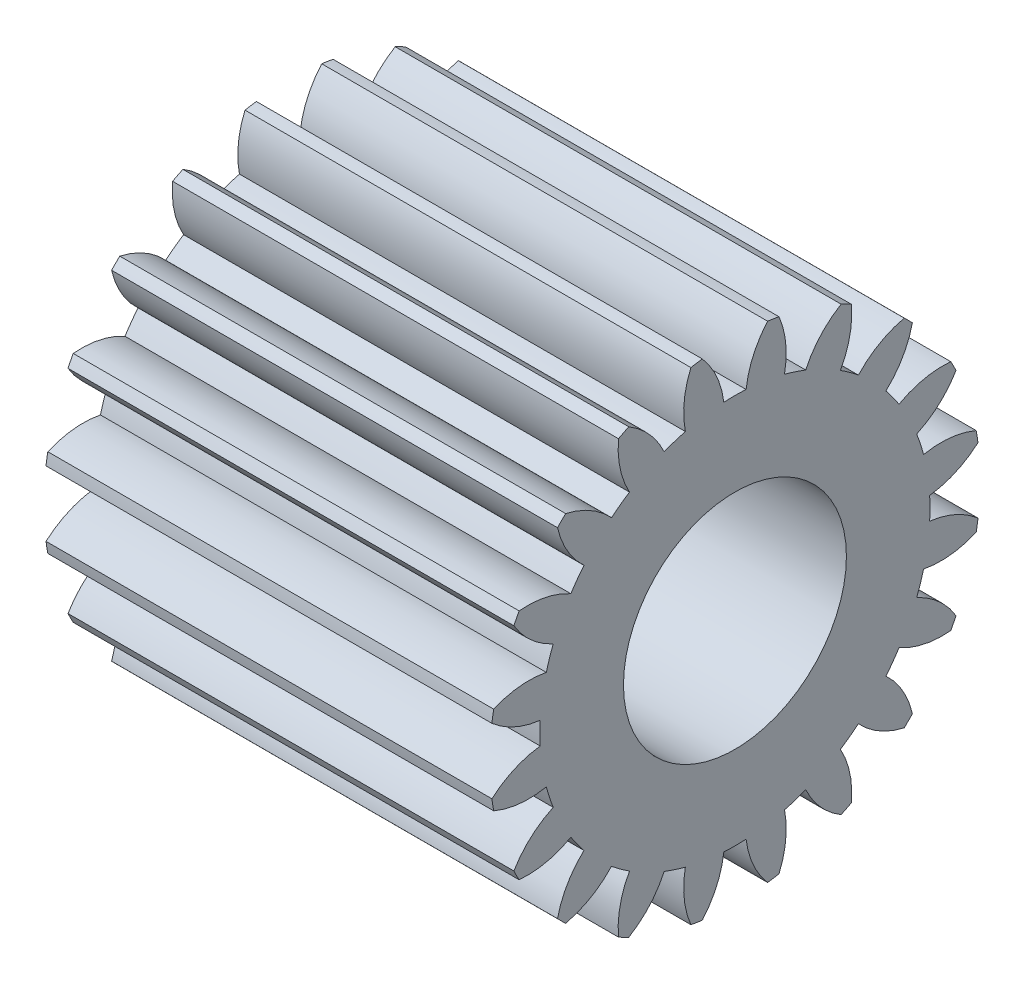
ISO-10303-21;
HEADER;
FILE_DESCRIPTION(('STEP AP214'),'2;1');
FILE_NAME('part.step','',(''),(''),'','','');
FILE_SCHEMA(('AUTOMOTIVE_DESIGN { 1 0 10303 214 1 1 1 1 }'));
ENDSEC;
DATA;
#1=APPLICATION_CONTEXT('core data for automotive mechanical design processes');
#2=APPLICATION_PROTOCOL_DEFINITION('international standard','automotive_design',2000,#1);
#3=PRODUCT_CONTEXT('',#1,'mechanical');
#4=PRODUCT('Part','Part','',(#3));
#5=PRODUCT_RELATED_PRODUCT_CATEGORY('part','',(#4));
#6=PRODUCT_DEFINITION_FORMATION('','',#4);
#7=PRODUCT_DEFINITION_CONTEXT('part definition',#1,'design');
#8=PRODUCT_DEFINITION('design','',#6,#7);
#9=PRODUCT_DEFINITION_SHAPE('','',#8);
#10=(LENGTH_UNIT() NAMED_UNIT(*) SI_UNIT(.MILLI.,.METRE.));
#11=(NAMED_UNIT(*) PLANE_ANGLE_UNIT() SI_UNIT($,.RADIAN.));
#12=(NAMED_UNIT(*) SI_UNIT($,.STERADIAN.) SOLID_ANGLE_UNIT());
#13=UNCERTAINTY_MEASURE_WITH_UNIT(LENGTH_MEASURE(1.E-05),#10,'distance_accuracy_value','');
#14=(GEOMETRIC_REPRESENTATION_CONTEXT(3) GLOBAL_UNCERTAINTY_ASSIGNED_CONTEXT((#13)) GLOBAL_UNIT_ASSIGNED_CONTEXT((#10,
#11,#12)) REPRESENTATION_CONTEXT('',''));
#15=CARTESIAN_POINT('',(0.,0.,0.));
#16=DIRECTION('',(0.,0.,1.));
#17=DIRECTION('',(1.,0.,0.));
#18=AXIS2_PLACEMENT_3D('',#15,#16,#17);
#19=CARTESIAN_POINT('',(10.,0.,0.));
#20=DIRECTION('',(-1.,0.,0.));
#21=DIRECTION('',(0.,0.,1.));
#22=AXIS2_PLACEMENT_3D('',#19,#20,#21);
#23=PLANE('',#22);
#24=CARTESIAN_POINT('',(10.,0.,0.));
#25=DIRECTION('',(-1.,0.,0.));
#26=DIRECTION('',(0.,0.,1.));
#27=AXIS2_PLACEMENT_3D('',#24,#25,#26);
#28=CIRCLE('',#27,2.5);
#29=CARTESIAN_POINT('',(10.,0.,2.5));
#30=VERTEX_POINT('',#29);
#31=EDGE_CURVE('E773',#30,#30,#28,.F.);
#32=ORIENTED_EDGE('',*,*,#31,.F.);
#33=EDGE_LOOP('',(#32));
#34=FACE_BOUND('',#33,.T.);
#35=CARTESIAN_POINT('',(10.,2.23609483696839,4.13224338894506));
#36=DIRECTION('',(-1.,0.,0.));
#37=DIRECTION('',(0.,1.,0.));
#38=AXIS2_PLACEMENT_3D('',#35,#36,#37);
#39=CIRCLE('',#38,2.);
#40=CARTESIAN_POINT('',(10.,0.249903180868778,4.36685520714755));
#41=VERTEX_POINT('',#40);
#42=CARTESIAN_POINT('',(10.,0.732478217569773,5.4510068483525));
#43=VERTEX_POINT('',#42);
#44=EDGE_CURVE('E561',#41,#43,#39,.T.);
#45=ORIENTED_EDGE('',*,*,#44,.F.);
#46=CARTESIAN_POINT('',(10.,0.,0.));
#47=DIRECTION('',(-1.,0.,0.));
#48=DIRECTION('',(0.,1.,0.));
#49=AXIS2_PLACEMENT_3D('',#46,#47,#48);
#50=CIRCLE('',#49,4.374);
#51=CARTESIAN_POINT('',(10.,-0.249903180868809,4.36685520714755));
#52=VERTEX_POINT('',#51);
#53=EDGE_CURVE('E566',#52,#41,#50,.T.);
#54=ORIENTED_EDGE('',*,*,#53,.F.);
#55=CARTESIAN_POINT('',(10.,-2.23609483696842,4.13224338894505));
#56=DIRECTION('',(-1.,0.,0.));
#57=DIRECTION('',(0.,1.,0.));
#58=AXIS2_PLACEMENT_3D('',#55,#56,#57);
#59=CIRCLE('',#58,2.);
#60=CARTESIAN_POINT('',(10.,-0.73247821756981,5.45100684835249));
#61=VERTEX_POINT('',#60);
#62=EDGE_CURVE('E563',#61,#52,#59,.T.);
#63=ORIENTED_EDGE('',*,*,#62,.F.);
#64=CARTESIAN_POINT('',(10.,0.,0.));
#65=DIRECTION('',(-1.,0.,0.));
#66=DIRECTION('',(0.,0.,1.));
#67=AXIS2_PLACEMENT_3D('',#64,#65,#66);
#68=CIRCLE('',#67,5.5);
#69=CARTESIAN_POINT('',(10.,-0.987825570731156,5.41056380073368));
#70=VERTEX_POINT('',#69);
#71=EDGE_CURVE('E1113',#70,#61,#68,.T.);
#72=ORIENTED_EDGE('',*,*,#71,.F.);
#73=CARTESIAN_POINT('',(10.,0.849719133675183,4.62098830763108));
#74=DIRECTION('',(-1.,0.,0.));
#75=DIRECTION('',(0.,0.951056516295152,0.309016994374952));
#76=AXIS2_PLACEMENT_3D('',#73,#74,#75);
#77=CIRCLE('',#76,2.);
#78=CARTESIAN_POINT('',(10.,-1.11176042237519,4.23035043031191));
#79=VERTEX_POINT('',#78);
#80=EDGE_CURVE('E679',#79,#70,#77,.T.);
#81=ORIENTED_EDGE('',*,*,#80,.F.);
#82=CARTESIAN_POINT('',(10.,0.,0.));
#83=DIRECTION('',(-1.,0.,0.));
#84=DIRECTION('',(0.,0.951056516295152,0.309016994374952));
#85=AXIS2_PLACEMENT_3D('',#82,#83,#84);
#86=CIRCLE('',#85,4.374);
#87=CARTESIAN_POINT('',(10.,-1.58710451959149,4.07590177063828));
#88=VERTEX_POINT('',#87);
#89=EDGE_CURVE('E684',#88,#79,#86,.T.);
#90=ORIENTED_EDGE('',*,*,#89,.F.);
#91=CARTESIAN_POINT('',(10.,-3.40358599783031,3.23900569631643));
#92=DIRECTION('',(-1.,0.,0.));
#93=DIRECTION('',(0.,0.951056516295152,0.309016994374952));
#94=AXIS2_PLACEMENT_3D('',#91,#92,#93);
#95=CIRCLE('',#94,2.);
#96=CARTESIAN_POINT('',(10.,-2.38108193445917,4.9578673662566));
#97=VERTEX_POINT('',#96);
#98=EDGE_CURVE('E681',#97,#88,#95,.T.);
#99=ORIENTED_EDGE('',*,*,#98,.F.);
#100=CARTESIAN_POINT('',(10.,-2.61143410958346,4.84049707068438));
#101=VERTEX_POINT('',#100);
#102=EDGE_CURVE('E1091',#101,#97,#68,.T.);
#103=ORIENTED_EDGE('',*,*,#102,.F.);
#104=CARTESIAN_POINT('',(10.,-0.619832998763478,4.65739869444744));
#105=DIRECTION('',(-1.,0.,0.));
#106=DIRECTION('',(0.,0.809016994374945,0.587785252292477));
#107=AXIS2_PLACEMENT_3D('',#104,#105,#106);
#108=CIRCLE('',#107,2.);
#109=CARTESIAN_POINT('',(10.,-2.36459716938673,3.67974947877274));
#110=VERTEX_POINT('',#109);
#111=EDGE_CURVE('E662',#110,#101,#108,.T.);
#112=ORIENTED_EDGE('',*,*,#111,.F.);
#113=CARTESIAN_POINT('',(10.,0.,0.));
#114=DIRECTION('',(-1.,0.,0.));
#115=DIRECTION('',(0.,0.809016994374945,0.587785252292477));
#116=AXIS2_PLACEMENT_3D('',#113,#114,#115);
#117=CIRCLE('',#116,4.374);
#118=CARTESIAN_POINT('',(10.,-2.76894900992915,3.38597067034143));
#119=VERTEX_POINT('',#118);
#120=EDGE_CURVE('E667',#119,#110,#117,.T.);
#121=ORIENTED_EDGE('',*,*,#120,.F.);
#122=CARTESIAN_POINT('',(10.,-4.2379104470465,2.02871155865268));
#123=DIRECTION('',(-1.,0.,0.));
#124=DIRECTION('',(0.,0.809016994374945,0.587785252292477));
#125=AXIS2_PLACEMENT_3D('',#122,#123,#124);
#126=CIRCLE('',#125,2.);
#127=CARTESIAN_POINT('',(10.,-3.79660876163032,3.97941728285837));
#128=VERTEX_POINT('',#127);
#129=EDGE_CURVE('E664',#128,#119,#126,.T.);
#130=ORIENTED_EDGE('',*,*,#129,.F.);
#131=CARTESIAN_POINT('',(10.,-3.97941728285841,3.79660876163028));
#132=VERTEX_POINT('',#131);
#133=EDGE_CURVE('E1203',#132,#128,#68,.T.);
#134=ORIENTED_EDGE('',*,*,#133,.F.);
#135=CARTESIAN_POINT('',(10.,-2.02871155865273,4.23791044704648));
#136=DIRECTION('',(-1.,0.,0.));
#137=DIRECTION('',(0.,0.587785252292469,0.809016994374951));
#138=AXIS2_PLACEMENT_3D('',#135,#136,#137);
#139=CIRCLE('',#138,2.);
#140=CARTESIAN_POINT('',(10.,-3.38597067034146,2.76894900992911));
#141=VERTEX_POINT('',#140);
#142=EDGE_CURVE('E645',#141,#132,#139,.T.);
#143=ORIENTED_EDGE('',*,*,#142,.F.);
#144=CARTESIAN_POINT('',(10.,0.,0.));
#145=DIRECTION('',(-1.,0.,0.));
#146=DIRECTION('',(0.,0.587785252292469,0.809016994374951));
#147=AXIS2_PLACEMENT_3D('',#144,#145,#146);
#148=CIRCLE('',#147,4.374);
#149=CARTESIAN_POINT('',(10.,-3.67974947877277,2.36459716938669));
#150=VERTEX_POINT('',#149);
#151=EDGE_CURVE('E650',#150,#141,#148,.T.);
#152=ORIENTED_EDGE('',*,*,#151,.F.);
#153=CARTESIAN_POINT('',(10.,-4.65739869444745,0.619832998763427));
#154=DIRECTION('',(-1.,0.,0.));
#155=DIRECTION('',(0.,0.587785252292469,0.809016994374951));
#156=AXIS2_PLACEMENT_3D('',#153,#154,#155);
#157=CIRCLE('',#156,2.);
#158=CARTESIAN_POINT('',(10.,-4.8404970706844,2.61143410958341));
#159=VERTEX_POINT('',#158);
#160=EDGE_CURVE('E647',#159,#150,#157,.T.);
#161=ORIENTED_EDGE('',*,*,#160,.F.);
#162=CARTESIAN_POINT('',(10.,-4.95786736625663,2.38108193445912));
#163=VERTEX_POINT('',#162);
#164=EDGE_CURVE('E1197',#163,#159,#68,.T.);
#165=ORIENTED_EDGE('',*,*,#164,.F.);
#166=CARTESIAN_POINT('',(10.,-3.23900569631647,3.40358599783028));
#167=DIRECTION('',(-1.,0.,0.));
#168=DIRECTION('',(0.,0.309016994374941,0.951056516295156));
#169=AXIS2_PLACEMENT_3D('',#166,#167,#168);
#170=CIRCLE('',#169,2.);
#171=CARTESIAN_POINT('',(10.,-4.0759017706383,1.58710451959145));
#172=VERTEX_POINT('',#171);
#173=EDGE_CURVE('E609',#172,#163,#170,.T.);
#174=ORIENTED_EDGE('',*,*,#173,.F.);
#175=CARTESIAN_POINT('',(10.,0.,0.));
#176=DIRECTION('',(-1.,0.,0.));
#177=DIRECTION('',(0.,0.309016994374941,0.951056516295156));
#178=AXIS2_PLACEMENT_3D('',#175,#176,#177);
#179=CIRCLE('',#178,4.374);
#180=CARTESIAN_POINT('',(10.,-4.23035043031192,1.11176042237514));
#181=VERTEX_POINT('',#180);
#182=EDGE_CURVE('E614',#181,#172,#179,.T.);
#183=ORIENTED_EDGE('',*,*,#182,.F.);
#184=CARTESIAN_POINT('',(10.,-4.62098830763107,-0.849719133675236));
#185=DIRECTION('',(-1.,0.,0.));
#186=DIRECTION('',(0.,0.309016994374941,0.951056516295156));
#187=AXIS2_PLACEMENT_3D('',#184,#185,#186);
#188=CIRCLE('',#187,2.);
#189=CARTESIAN_POINT('',(10.,-5.41056380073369,0.987825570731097));
#190=VERTEX_POINT('',#189);
#191=EDGE_CURVE('E611',#190,#181,#188,.T.);
#192=ORIENTED_EDGE('',*,*,#191,.F.);
#193=CARTESIAN_POINT('',(10.,-5.4510068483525,0.732478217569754));
#194=VERTEX_POINT('',#193);
#195=EDGE_CURVE('E1191',#194,#190,#68,.T.);
#196=ORIENTED_EDGE('',*,*,#195,.F.);
#197=CARTESIAN_POINT('',(10.,-4.13224338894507,2.23609483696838));
#198=DIRECTION('',(-1.,0.,0.));
#199=DIRECTION('',(0.,0.,1.));
#200=AXIS2_PLACEMENT_3D('',#197,#198,#199);
#201=CIRCLE('',#200,2.);
#202=CARTESIAN_POINT('',(10.,-4.36685520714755,0.249903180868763));
#203=VERTEX_POINT('',#202);
#204=EDGE_CURVE('E628',#203,#194,#201,.T.);
#205=ORIENTED_EDGE('',*,*,#204,.F.);
#206=CARTESIAN_POINT('',(10.,0.,0.));
#207=DIRECTION('',(-1.,0.,0.));
#208=DIRECTION('',(0.,0.,1.));
#209=AXIS2_PLACEMENT_3D('',#206,#207,#208);
#210=CIRCLE('',#209,4.374);
#211=CARTESIAN_POINT('',(10.,-4.36685520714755,-0.249903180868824));
#212=VERTEX_POINT('',#211);
#213=EDGE_CURVE('E633',#212,#203,#210,.T.);
#214=ORIENTED_EDGE('',*,*,#213,.F.);
#215=CARTESIAN_POINT('',(10.,-4.13224338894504,-2.23609483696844));
#216=DIRECTION('',(-1.,0.,0.));
#217=DIRECTION('',(0.,0.,1.));
#218=AXIS2_PLACEMENT_3D('',#215,#216,#217);
#219=CIRCLE('',#218,2.);
#220=CARTESIAN_POINT('',(10.,-5.45100684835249,-0.73247821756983));
#221=VERTEX_POINT('',#220);
#222=EDGE_CURVE('E630',#221,#212,#219,.T.);
#223=ORIENTED_EDGE('',*,*,#222,.F.);
#224=CARTESIAN_POINT('',(10.,-5.41056380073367,-0.987825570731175));
#225=VERTEX_POINT('',#224);
#226=EDGE_CURVE('E1185',#225,#221,#68,.T.);
#227=ORIENTED_EDGE('',*,*,#226,.F.);
#228=CARTESIAN_POINT('',(10.,-4.62098830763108,0.849719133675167));
#229=DIRECTION('',(-1.,0.,0.));
#230=DIRECTION('',(0.,-0.309016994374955,0.951056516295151));
#231=AXIS2_PLACEMENT_3D('',#228,#229,#230);
#232=CIRCLE('',#231,2.);
#233=CARTESIAN_POINT('',(10.,-4.2303504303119,-1.1117604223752));
#234=VERTEX_POINT('',#233);
#235=EDGE_CURVE('E747',#234,#225,#232,.T.);
#236=ORIENTED_EDGE('',*,*,#235,.F.);
#237=CARTESIAN_POINT('',(10.,0.,0.));
#238=DIRECTION('',(-1.,0.,0.));
#239=DIRECTION('',(0.,-0.309016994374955,0.951056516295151));
#240=AXIS2_PLACEMENT_3D('',#237,#238,#239);
#241=CIRCLE('',#240,4.374);
#242=CARTESIAN_POINT('',(10.,-4.07590177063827,-1.58710451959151));
#243=VERTEX_POINT('',#242);
#244=EDGE_CURVE('E752',#243,#234,#241,.T.);
#245=ORIENTED_EDGE('',*,*,#244,.F.);
#246=CARTESIAN_POINT('',(10.,-3.23900569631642,-3.40358599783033));
#247=DIRECTION('',(-1.,0.,0.));
#248=DIRECTION('',(0.,-0.309016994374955,0.951056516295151));
#249=AXIS2_PLACEMENT_3D('',#246,#247,#248);
#250=CIRCLE('',#249,2.);
#251=CARTESIAN_POINT('',(10.,-4.95786736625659,-2.38108193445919));
#252=VERTEX_POINT('',#251);
#253=EDGE_CURVE('E749',#252,#243,#250,.T.);
#254=ORIENTED_EDGE('',*,*,#253,.F.);
#255=CARTESIAN_POINT('',(10.,-4.84049707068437,-2.61143410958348));
#256=VERTEX_POINT('',#255);
#257=EDGE_CURVE('E1179',#256,#252,#68,.T.);
#258=ORIENTED_EDGE('',*,*,#257,.F.);
#259=CARTESIAN_POINT('',(10.,-4.65739869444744,-0.619832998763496));
#260=DIRECTION('',(-1.,0.,0.));
#261=DIRECTION('',(0.,-0.58778525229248,0.809016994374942));
#262=AXIS2_PLACEMENT_3D('',#259,#260,#261);
#263=CIRCLE('',#262,2.);
#264=CARTESIAN_POINT('',(10.,-3.67974947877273,-2.36459716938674));
#265=VERTEX_POINT('',#264);
#266=EDGE_CURVE('E730',#265,#256,#263,.T.);
#267=ORIENTED_EDGE('',*,*,#266,.F.);
#268=CARTESIAN_POINT('',(10.,0.,0.));
#269=DIRECTION('',(-1.,0.,0.));
#270=DIRECTION('',(0.,-0.58778525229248,0.809016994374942));
#271=AXIS2_PLACEMENT_3D('',#268,#269,#270);
#272=CIRCLE('',#271,4.374);
#273=CARTESIAN_POINT('',(10.,-3.38597067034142,-2.76894900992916));
#274=VERTEX_POINT('',#273);
#275=EDGE_CURVE('E735',#274,#265,#272,.T.);
#276=ORIENTED_EDGE('',*,*,#275,.F.);
#277=CARTESIAN_POINT('',(10.,-2.02871155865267,-4.23791044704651));
#278=DIRECTION('',(-1.,0.,0.));
#279=DIRECTION('',(0.,-0.58778525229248,0.809016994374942));
#280=AXIS2_PLACEMENT_3D('',#277,#278,#279);
#281=CIRCLE('',#280,2.);
#282=CARTESIAN_POINT('',(10.,-3.97941728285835,-3.79660876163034));
#283=VERTEX_POINT('',#282);
#284=EDGE_CURVE('E732',#283,#274,#281,.T.);
#285=ORIENTED_EDGE('',*,*,#284,.F.);
#286=CARTESIAN_POINT('',(10.,-3.79660876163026,-3.97941728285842));
#287=VERTEX_POINT('',#286);
#288=EDGE_CURVE('E1173',#287,#283,#68,.T.);
#289=ORIENTED_EDGE('',*,*,#288,.F.);
#290=CARTESIAN_POINT('',(10.,-4.23791044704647,-2.02871155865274));
#291=DIRECTION('',(-1.,0.,0.));
#292=DIRECTION('',(0.,-0.809016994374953,0.587785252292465));
#293=AXIS2_PLACEMENT_3D('',#290,#291,#292);
#294=CIRCLE('',#293,2.);
#295=CARTESIAN_POINT('',(10.,-2.7689490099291,-3.38597067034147));
#296=VERTEX_POINT('',#295);
#297=EDGE_CURVE('E713',#296,#287,#294,.T.);
#298=ORIENTED_EDGE('',*,*,#297,.F.);
#299=CARTESIAN_POINT('',(10.,0.,0.));
#300=DIRECTION('',(-1.,0.,0.));
#301=DIRECTION('',(0.,-0.809016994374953,0.587785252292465));
#302=AXIS2_PLACEMENT_3D('',#299,#300,#301);
#303=CIRCLE('',#302,4.374);
#304=CARTESIAN_POINT('',(10.,-2.36459716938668,-3.67974947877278));
#305=VERTEX_POINT('',#304);
#306=EDGE_CURVE('E718',#305,#296,#303,.T.);
#307=ORIENTED_EDGE('',*,*,#306,.F.);
#308=CARTESIAN_POINT('',(10.,-0.619832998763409,-4.65739869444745));
#309=DIRECTION('',(-1.,0.,0.));
#310=DIRECTION('',(0.,-0.809016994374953,0.587785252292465));
#311=AXIS2_PLACEMENT_3D('',#308,#309,#310);
#312=CIRCLE('',#311,2.);
#313=CARTESIAN_POINT('',(10.,-2.61143410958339,-4.84049707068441));
#314=VERTEX_POINT('',#313);
#315=EDGE_CURVE('E715',#314,#305,#312,.T.);
#316=ORIENTED_EDGE('',*,*,#315,.F.);
#317=CARTESIAN_POINT('',(10.,-2.3810819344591,-4.95786736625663));
#318=VERTEX_POINT('',#317);
#319=EDGE_CURVE('E1167',#318,#314,#68,.T.);
#320=ORIENTED_EDGE('',*,*,#319,.F.);
#321=CARTESIAN_POINT('',(10.,-3.40358599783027,-3.23900569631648));
#322=DIRECTION('',(-1.,0.,0.));
#323=DIRECTION('',(0.,-0.951056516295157,0.309016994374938));
#324=AXIS2_PLACEMENT_3D('',#321,#322,#323);
#325=CIRCLE('',#324,2.);
#326=CARTESIAN_POINT('',(10.,-1.58710451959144,-4.0759017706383));
#327=VERTEX_POINT('',#326);
#328=EDGE_CURVE('E694',#327,#318,#325,.T.);
#329=ORIENTED_EDGE('',*,*,#328,.F.);
#330=CARTESIAN_POINT('',(10.,0.,0.));
#331=DIRECTION('',(-1.,0.,0.));
#332=DIRECTION('',(0.,-0.951056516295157,0.309016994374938));
#333=AXIS2_PLACEMENT_3D('',#330,#331,#332);
#334=CIRCLE('',#333,4.374);
#335=CARTESIAN_POINT('',(10.,-1.11176042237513,-4.23035043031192));
#336=VERTEX_POINT('',#335);
#337=EDGE_CURVE('E699',#336,#327,#334,.T.);
#338=ORIENTED_EDGE('',*,*,#337,.F.);
#339=CARTESIAN_POINT('',(10.,0.849719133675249,-4.62098830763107));
#340=DIRECTION('',(-1.,0.,0.));
#341=DIRECTION('',(0.,-0.951056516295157,0.309016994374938));
#342=AXIS2_PLACEMENT_3D('',#339,#340,#341);
#343=CIRCLE('',#342,2.);
#344=CARTESIAN_POINT('',(10.,-0.987825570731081,-5.41056380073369));
#345=VERTEX_POINT('',#344);
#346=EDGE_CURVE('E696',#345,#336,#343,.T.);
#347=ORIENTED_EDGE('',*,*,#346,.F.);
#348=CARTESIAN_POINT('',(10.,-0.732478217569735,-5.4510068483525));
#349=VERTEX_POINT('',#348);
#350=EDGE_CURVE('E1161',#349,#345,#68,.T.);
#351=ORIENTED_EDGE('',*,*,#350,.F.);
#352=CARTESIAN_POINT('',(10.,-2.23609483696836,-4.13224338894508));
#353=DIRECTION('',(-1.,0.,0.));
#354=DIRECTION('',(0.,-1.,0.));
#355=AXIS2_PLACEMENT_3D('',#352,#353,#354);
#356=CIRCLE('',#355,2.);
#357=CARTESIAN_POINT('',(10.,-0.249903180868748,-4.36685520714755));
#358=VERTEX_POINT('',#357);
#359=EDGE_CURVE('E815',#358,#349,#356,.T.);
#360=ORIENTED_EDGE('',*,*,#359,.F.);
#361=CARTESIAN_POINT('',(10.,0.,0.));
#362=DIRECTION('',(-1.,0.,0.));
#363=DIRECTION('',(0.,-1.,0.));
#364=AXIS2_PLACEMENT_3D('',#361,#362,#363);
#365=CIRCLE('',#364,4.374);
#366=CARTESIAN_POINT('',(10.,0.24990318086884,-4.36685520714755));
#367=VERTEX_POINT('',#366);
#368=EDGE_CURVE('E820',#367,#358,#365,.T.);
#369=ORIENTED_EDGE('',*,*,#368,.F.);
#370=CARTESIAN_POINT('',(10.,2.23609483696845,-4.13224338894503));
#371=DIRECTION('',(-1.,0.,0.));
#372=DIRECTION('',(0.,-1.,0.));
#373=AXIS2_PLACEMENT_3D('',#370,#371,#372);
#374=CIRCLE('',#373,2.);
#375=CARTESIAN_POINT('',(10.,0.732478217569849,-5.45100684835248));
#376=VERTEX_POINT('',#375);
#377=EDGE_CURVE('E817',#376,#367,#374,.T.);
#378=ORIENTED_EDGE('',*,*,#377,.F.);
#379=CARTESIAN_POINT('',(10.,0.987825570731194,-5.41056380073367));
#380=VERTEX_POINT('',#379);
#381=EDGE_CURVE('E1155',#380,#376,#68,.T.);
#382=ORIENTED_EDGE('',*,*,#381,.F.);
#383=CARTESIAN_POINT('',(10.,-0.849719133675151,-4.62098830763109));
#384=DIRECTION('',(-1.,0.,0.));
#385=DIRECTION('',(0.,-0.95105651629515,-0.309016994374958));
#386=AXIS2_PLACEMENT_3D('',#383,#384,#385);
#387=CIRCLE('',#386,2.);
#388=CARTESIAN_POINT('',(10.,1.11176042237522,-4.2303504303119));
#389=VERTEX_POINT('',#388);
#390=EDGE_CURVE('E832',#389,#380,#387,.T.);
#391=ORIENTED_EDGE('',*,*,#390,.F.);
#392=CARTESIAN_POINT('',(10.,0.,0.));
#393=DIRECTION('',(-1.,0.,0.));
#394=DIRECTION('',(0.,-0.95105651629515,-0.309016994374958));
#395=AXIS2_PLACEMENT_3D('',#392,#393,#394);
#396=CIRCLE('',#395,4.374);
#397=CARTESIAN_POINT('',(10.,1.58710451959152,-4.07590177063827));
#398=VERTEX_POINT('',#397);
#399=EDGE_CURVE('E837',#398,#389,#396,.T.);
#400=ORIENTED_EDGE('',*,*,#399,.F.);
#401=CARTESIAN_POINT('',(10.,3.40358599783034,-3.23900569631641));
#402=DIRECTION('',(-1.,0.,0.));
#403=DIRECTION('',(0.,-0.95105651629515,-0.309016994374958));
#404=AXIS2_PLACEMENT_3D('',#401,#402,#403);
#405=CIRCLE('',#404,2.);
#406=CARTESIAN_POINT('',(10.,2.38108193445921,-4.95786736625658));
#407=VERTEX_POINT('',#406);
#408=EDGE_CURVE('E834',#407,#398,#405,.T.);
#409=ORIENTED_EDGE('',*,*,#408,.F.);
#410=CARTESIAN_POINT('',(10.,2.6114341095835,-4.84049707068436));
#411=VERTEX_POINT('',#410);
#412=EDGE_CURVE('E1149',#411,#407,#68,.T.);
#413=ORIENTED_EDGE('',*,*,#412,.F.);
#414=CARTESIAN_POINT('',(10.,0.619832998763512,-4.65739869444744));
#415=DIRECTION('',(-1.,0.,0.));
#416=DIRECTION('',(0.,-0.80901699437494,-0.587785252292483));
#417=AXIS2_PLACEMENT_3D('',#414,#415,#416);
#418=CIRCLE('',#417,2.);
#419=CARTESIAN_POINT('',(10.,2.36459716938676,-3.67974947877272));
#420=VERTEX_POINT('',#419);
#421=EDGE_CURVE('E798',#420,#411,#418,.T.);
#422=ORIENTED_EDGE('',*,*,#421,.F.);
#423=CARTESIAN_POINT('',(10.,0.,0.));
#424=DIRECTION('',(-1.,0.,0.));
#425=DIRECTION('',(0.,-0.80901699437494,-0.587785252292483));
#426=AXIS2_PLACEMENT_3D('',#423,#424,#425);
#427=CIRCLE('',#426,4.374);
#428=CARTESIAN_POINT('',(10.,2.76894900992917,-3.38597067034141));
#429=VERTEX_POINT('',#428);
#430=EDGE_CURVE('E803',#429,#420,#427,.T.);
#431=ORIENTED_EDGE('',*,*,#430,.F.);
#432=CARTESIAN_POINT('',(10.,4.23791044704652,-2.02871155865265));
#433=DIRECTION('',(-1.,0.,0.));
#434=DIRECTION('',(0.,-0.80901699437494,-0.587785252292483));
#435=AXIS2_PLACEMENT_3D('',#432,#433,#434);
#436=CIRCLE('',#435,2.);
#437=CARTESIAN_POINT('',(10.,3.79660876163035,-3.97941728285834));
#438=VERTEX_POINT('',#437);
#439=EDGE_CURVE('E800',#438,#429,#436,.T.);
#440=ORIENTED_EDGE('',*,*,#439,.F.);
#441=CARTESIAN_POINT('',(10.,3.97941728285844,-3.79660876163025));
#442=VERTEX_POINT('',#441);
#443=EDGE_CURVE('E1143',#442,#438,#68,.T.);
#444=ORIENTED_EDGE('',*,*,#443,.F.);
#445=CARTESIAN_POINT('',(10.,2.02871155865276,-4.23791044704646));
#446=DIRECTION('',(-1.,0.,0.));
#447=DIRECTION('',(0.,-0.587785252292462,-0.809016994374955));
#448=AXIS2_PLACEMENT_3D('',#445,#446,#447);
#449=CIRCLE('',#448,2.);
#450=CARTESIAN_POINT('',(10.,3.38597067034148,-2.76894900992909));
#451=VERTEX_POINT('',#450);
#452=EDGE_CURVE('E781',#451,#442,#449,.T.);
#453=ORIENTED_EDGE('',*,*,#452,.F.);
#454=CARTESIAN_POINT('',(10.,0.,0.));
#455=DIRECTION('',(-1.,0.,0.));
#456=DIRECTION('',(0.,-0.587785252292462,-0.809016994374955));
#457=AXIS2_PLACEMENT_3D('',#454,#455,#456);
#458=CIRCLE('',#457,4.374);
#459=CARTESIAN_POINT('',(10.,3.67974947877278,-2.36459716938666));
#460=VERTEX_POINT('',#459);
#461=EDGE_CURVE('E786',#460,#451,#458,.T.);
#462=ORIENTED_EDGE('',*,*,#461,.F.);
#463=CARTESIAN_POINT('',(10.,4.65739869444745,-0.619832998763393));
#464=DIRECTION('',(-1.,0.,0.));
#465=DIRECTION('',(0.,-0.587785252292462,-0.809016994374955));
#466=AXIS2_PLACEMENT_3D('',#463,#464,#465);
#467=CIRCLE('',#466,2.);
#468=CARTESIAN_POINT('',(10.,4.84049707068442,-2.61143410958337));
#469=VERTEX_POINT('',#468);
#470=EDGE_CURVE('E783',#469,#460,#467,.T.);
#471=ORIENTED_EDGE('',*,*,#470,.F.);
#472=CARTESIAN_POINT('',(10.,4.95786736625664,-2.38108193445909));
#473=VERTEX_POINT('',#472);
#474=EDGE_CURVE('E972',#473,#469,#68,.T.);
#475=ORIENTED_EDGE('',*,*,#474,.F.);
#476=CARTESIAN_POINT('',(10.,3.23900569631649,-3.40358599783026));
#477=DIRECTION('',(-1.,0.,0.));
#478=DIRECTION('',(0.,-0.309016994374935,-0.951056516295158));
#479=AXIS2_PLACEMENT_3D('',#476,#477,#478);
#480=CIRCLE('',#479,2.);
#481=CARTESIAN_POINT('',(10.,4.07590177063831,-1.58710451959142));
#482=VERTEX_POINT('',#481);
#483=EDGE_CURVE('E762',#482,#473,#480,.T.);
#484=ORIENTED_EDGE('',*,*,#483,.F.);
#485=CARTESIAN_POINT('',(10.,0.,0.));
#486=DIRECTION('',(-1.,0.,0.));
#487=DIRECTION('',(0.,-0.309016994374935,-0.951056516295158));
#488=AXIS2_PLACEMENT_3D('',#485,#486,#487);
#489=CIRCLE('',#488,4.374);
#490=CARTESIAN_POINT('',(10.,4.23035043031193,-1.11176042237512));
#491=VERTEX_POINT('',#490);
#492=EDGE_CURVE('E767',#491,#482,#489,.T.);
#493=ORIENTED_EDGE('',*,*,#492,.F.);
#494=CARTESIAN_POINT('',(10.,4.62098830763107,0.849719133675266));
#495=DIRECTION('',(-1.,0.,0.));
#496=DIRECTION('',(0.,-0.309016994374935,-0.951056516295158));
#497=AXIS2_PLACEMENT_3D('',#494,#495,#496);
#498=CIRCLE('',#497,2.);
#499=CARTESIAN_POINT('',(10.,5.4105638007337,-0.987825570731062));
#500=VERTEX_POINT('',#499);
#501=EDGE_CURVE('E764',#500,#491,#498,.T.);
#502=ORIENTED_EDGE('',*,*,#501,.F.);
#503=CARTESIAN_POINT('',(10.,5.45100684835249,-0.732478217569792));
#504=VERTEX_POINT('',#503);
#505=EDGE_CURVE('E968',#504,#500,#68,.T.);
#506=ORIENTED_EDGE('',*,*,#505,.F.);
#507=CARTESIAN_POINT('',(10.,4.13224338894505,-2.23609483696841));
#508=DIRECTION('',(-1.,0.,0.));
#509=DIRECTION('',(0.,0.,-1.));
#510=AXIS2_PLACEMENT_3D('',#507,#508,#509);
#511=CIRCLE('',#510,2.);
#512=CARTESIAN_POINT('',(10.,4.36685520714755,-0.249903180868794));
#513=VERTEX_POINT('',#512);
#514=EDGE_CURVE('E940',#513,#504,#511,.T.);
#515=ORIENTED_EDGE('',*,*,#514,.F.);
#516=CARTESIAN_POINT('',(10.,0.,0.));
#517=DIRECTION('',(-1.,0.,0.));
#518=DIRECTION('',(0.,0.,-1.));
#519=AXIS2_PLACEMENT_3D('',#516,#517,#518);
#520=CIRCLE('',#519,4.374);
#521=CARTESIAN_POINT('',(10.,4.36685520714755,0.249903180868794));
#522=VERTEX_POINT('',#521);
#523=EDGE_CURVE('E945',#522,#513,#520,.T.);
#524=ORIENTED_EDGE('',*,*,#523,.F.);
#525=CARTESIAN_POINT('',(10.,4.13224338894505,2.23609483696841));
#526=DIRECTION('',(-1.,0.,0.));
#527=DIRECTION('',(0.,0.,-1.));
#528=AXIS2_PLACEMENT_3D('',#525,#526,#527);
#529=CIRCLE('',#528,2.);
#530=CARTESIAN_POINT('',(10.,5.45100684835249,0.732478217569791));
#531=VERTEX_POINT('',#530);
#532=EDGE_CURVE('E942',#531,#522,#529,.T.);
#533=ORIENTED_EDGE('',*,*,#532,.F.);
#534=CARTESIAN_POINT('',(10.,5.41056380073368,0.987825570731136));
#535=VERTEX_POINT('',#534);
#536=EDGE_CURVE('E965',#535,#531,#68,.T.);
#537=ORIENTED_EDGE('',*,*,#536,.F.);
#538=CARTESIAN_POINT('',(10.,4.62098830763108,-0.8497191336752));
#539=DIRECTION('',(-1.,0.,0.));
#540=DIRECTION('',(0.,0.309016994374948,-0.951056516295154));
#541=AXIS2_PLACEMENT_3D('',#538,#539,#540);
#542=CIRCLE('',#541,2.);
#543=CARTESIAN_POINT('',(10.,4.23035043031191,1.11176042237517));
#544=VERTEX_POINT('',#543);
#545=EDGE_CURVE('E918',#544,#535,#542,.T.);
#546=ORIENTED_EDGE('',*,*,#545,.F.);
#547=CARTESIAN_POINT('',(10.,0.,0.));
#548=DIRECTION('',(-1.,0.,0.));
#549=DIRECTION('',(0.,0.309016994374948,-0.951056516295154));
#550=AXIS2_PLACEMENT_3D('',#547,#548,#549);
#551=CIRCLE('',#550,4.374);
#552=CARTESIAN_POINT('',(10.,4.07590177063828,1.58710451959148));
#553=VERTEX_POINT('',#552);
#554=EDGE_CURVE('E923',#553,#544,#551,.T.);
#555=ORIENTED_EDGE('',*,*,#554,.F.);
#556=CARTESIAN_POINT('',(10.,3.23900569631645,3.4035859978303));
#557=DIRECTION('',(-1.,0.,0.));
#558=DIRECTION('',(0.,0.309016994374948,-0.951056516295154));
#559=AXIS2_PLACEMENT_3D('',#556,#557,#558);
#560=CIRCLE('',#559,2.);
#561=CARTESIAN_POINT('',(10.,4.95786736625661,2.38108193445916));
#562=VERTEX_POINT('',#561);
#563=EDGE_CURVE('E920',#562,#553,#560,.T.);
#564=ORIENTED_EDGE('',*,*,#563,.F.);
#565=CARTESIAN_POINT('',(10.,4.84049707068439,2.61143410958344));
#566=VERTEX_POINT('',#565);
#567=EDGE_CURVE('E973',#566,#562,#68,.T.);
#568=ORIENTED_EDGE('',*,*,#567,.F.);
#569=CARTESIAN_POINT('',(10.,4.65739869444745,0.619832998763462));
#570=DIRECTION('',(-1.,0.,0.));
#571=DIRECTION('',(0.,0.587785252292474,-0.809016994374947));
#572=AXIS2_PLACEMENT_3D('',#569,#570,#571);
#573=CIRCLE('',#572,2.);
#574=CARTESIAN_POINT('',(10.,3.67974947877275,2.36459716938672));
#575=VERTEX_POINT('',#574);
#576=EDGE_CURVE('E592',#575,#566,#573,.T.);
#577=ORIENTED_EDGE('',*,*,#576,.F.);
#578=CARTESIAN_POINT('',(10.,0.,0.));
#579=DIRECTION('',(-1.,0.,0.));
#580=DIRECTION('',(0.,0.587785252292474,-0.809016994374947));
#581=AXIS2_PLACEMENT_3D('',#578,#579,#580);
#582=CIRCLE('',#581,4.374);
#583=CARTESIAN_POINT('',(10.,3.38597067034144,2.76894900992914));
#584=VERTEX_POINT('',#583);
#585=EDGE_CURVE('E597',#584,#575,#582,.T.);
#586=ORIENTED_EDGE('',*,*,#585,.F.);
#587=CARTESIAN_POINT('',(10.,2.0287115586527,4.23791044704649));
#588=DIRECTION('',(-1.,0.,0.));
#589=DIRECTION('',(0.,0.587785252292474,-0.809016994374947));
#590=AXIS2_PLACEMENT_3D('',#587,#588,#589);
#591=CIRCLE('',#590,2.);
#592=CARTESIAN_POINT('',(10.,3.97941728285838,3.79660876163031));
#593=VERTEX_POINT('',#592);
#594=EDGE_CURVE('E594',#593,#584,#591,.T.);
#595=ORIENTED_EDGE('',*,*,#594,.F.);
#596=CARTESIAN_POINT('',(10.,3.79660876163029,3.9794172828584));
#597=VERTEX_POINT('',#596);
#598=EDGE_CURVE('E1125',#597,#593,#68,.T.);
#599=ORIENTED_EDGE('',*,*,#598,.F.);
#600=CARTESIAN_POINT('',(10.,4.23791044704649,2.02871155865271));
#601=DIRECTION('',(-1.,0.,0.));
#602=DIRECTION('',(0.,0.809016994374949,-0.587785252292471));
#603=AXIS2_PLACEMENT_3D('',#600,#601,#602);
#604=CIRCLE('',#603,2.);
#605=CARTESIAN_POINT('',(10.,2.76894900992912,3.38597067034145));
#606=VERTEX_POINT('',#605);
#607=EDGE_CURVE('E575',#606,#597,#604,.T.);
#608=ORIENTED_EDGE('',*,*,#607,.F.);
#609=CARTESIAN_POINT('',(10.,0.,0.));
#610=DIRECTION('',(-1.,0.,0.));
#611=DIRECTION('',(0.,0.809016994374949,-0.587785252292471));
#612=AXIS2_PLACEMENT_3D('',#609,#610,#611);
#613=CIRCLE('',#612,4.374);
#614=CARTESIAN_POINT('',(10.,2.3645971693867,3.67974947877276));
#615=VERTEX_POINT('',#614);
#616=EDGE_CURVE('E580',#615,#606,#613,.T.);
#617=ORIENTED_EDGE('',*,*,#616,.F.);
#618=CARTESIAN_POINT('',(10.,0.619832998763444,4.65739869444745));
#619=DIRECTION('',(-1.,0.,0.));
#620=DIRECTION('',(0.,0.809016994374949,-0.587785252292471));
#621=AXIS2_PLACEMENT_3D('',#618,#619,#620);
#622=CIRCLE('',#621,2.);
#623=CARTESIAN_POINT('',(10.,2.61143410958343,4.8404970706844));
#624=VERTEX_POINT('',#623);
#625=EDGE_CURVE('E577',#624,#615,#622,.T.);
#626=ORIENTED_EDGE('',*,*,#625,.F.);
#627=CARTESIAN_POINT('',(10.,2.38108193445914,4.95786736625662));
#628=VERTEX_POINT('',#627);
#629=EDGE_CURVE('E1123',#628,#624,#68,.T.);
#630=ORIENTED_EDGE('',*,*,#629,.F.);
#631=CARTESIAN_POINT('',(10.,3.40358599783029,3.23900569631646));
#632=DIRECTION('',(-1.,0.,0.));
#633=DIRECTION('',(0.,0.951056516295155,-0.309016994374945));
#634=AXIS2_PLACEMENT_3D('',#631,#632,#633);
#635=CIRCLE('',#634,2.);
#636=CARTESIAN_POINT('',(10.,1.58710451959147,4.07590177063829));
#637=VERTEX_POINT('',#636);
#638=EDGE_CURVE('E541',#637,#628,#635,.T.);
#639=ORIENTED_EDGE('',*,*,#638,.F.);
#640=CARTESIAN_POINT('',(10.,0.,0.));
#641=DIRECTION('',(-1.,0.,0.));
#642=DIRECTION('',(0.,0.951056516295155,-0.309016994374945));
#643=AXIS2_PLACEMENT_3D('',#640,#641,#642);
#644=CIRCLE('',#643,4.374);
#645=CARTESIAN_POINT('',(10.,1.11176042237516,4.23035043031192));
#646=VERTEX_POINT('',#645);
#647=EDGE_CURVE('E540',#646,#637,#644,.T.);
#648=ORIENTED_EDGE('',*,*,#647,.F.);
#649=CARTESIAN_POINT('',(10.,-0.849719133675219,4.62098830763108));
#650=DIRECTION('',(-1.,0.,0.));
#651=DIRECTION('',(0.,0.951056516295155,-0.309016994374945));
#652=AXIS2_PLACEMENT_3D('',#649,#650,#651);
#653=CIRCLE('',#652,2.);
#654=CARTESIAN_POINT('',(10.,0.987825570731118,5.41056380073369));
#655=VERTEX_POINT('',#654);
#656=EDGE_CURVE('E529',#655,#646,#653,.T.);
#657=ORIENTED_EDGE('',*,*,#656,.F.);
#658=EDGE_CURVE('E1018',#43,#655,#68,.T.);
#659=ORIENTED_EDGE('',*,*,#658,.F.);
#660=EDGE_LOOP('',(#45,#54,#63,#72,#81,#90,#99,#103,#112,#121,#130,#134,#143,#152,#161,#165,
#174,#183,#192,#196,#205,#214,#223,#227,#236,#245,#254,#258,#267,#276,#285,#289,#298,#307,#316,
#320,#329,#338,#347,#351,#360,#369,#378,#382,#391,#400,#409,#413,#422,#431,#440,#444,#453,#462,
#471,#475,#484,#493,#502,#506,#515,#524,#533,#537,#546,#555,#564,#568,#577,#586,#595,#599,#608,
#617,#626,#630,#639,#648,#657,#659));
#661=FACE_BOUND('',#660,.T.);
#662=ADVANCED_FACE('F32',(#34,#661),#23,.F.);
#663=CARTESIAN_POINT('',(-10.,0.,0.));
#664=DIRECTION('',(-1.,0.,0.));
#665=DIRECTION('',(0.,0.,1.));
#666=AXIS2_PLACEMENT_3D('',#663,#664,#665);
#667=CYLINDRICAL_SURFACE('',#666,5.5);
#668=DIRECTION('',(-1.,0.,0.));
#669=VECTOR('',#668,1.);
#670=CARTESIAN_POINT('',(5.,0.732478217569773,5.4510068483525));
#671=LINE('',#670,#669);
#672=CARTESIAN_POINT('',(0.,0.732478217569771,5.45100684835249));
#673=VERTEX_POINT('',#672);
#674=EDGE_CURVE('E915',#43,#673,#671,.T.);
#675=ORIENTED_EDGE('',*,*,#674,.F.);
#676=ORIENTED_EDGE('',*,*,#658,.T.);
#677=DIRECTION('',(-1.,0.,0.));
#678=VECTOR('',#677,1.);
#679=CARTESIAN_POINT('',(5.,0.987825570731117,5.41056380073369));
#680=LINE('',#679,#678);
#681=CARTESIAN_POINT('',(0.,0.987825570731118,5.41056380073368));
#682=VERTEX_POINT('',#681);
#683=EDGE_CURVE('E535',#682,#655,#680,.F.);
#684=ORIENTED_EDGE('',*,*,#683,.F.);
#685=CARTESIAN_POINT('',(0.,0.,0.));
#686=DIRECTION('',(-1.,0.,0.));
#687=DIRECTION('',(0.,0.,1.));
#688=AXIS2_PLACEMENT_3D('',#685,#686,#687);
#689=CIRCLE('',#688,5.5);
#690=EDGE_CURVE('E1017',#673,#682,#689,.T.);
#691=ORIENTED_EDGE('',*,*,#690,.F.);
#692=EDGE_LOOP('',(#675,#676,#684,#691));
#693=FACE_BOUND('',#692,.T.);
#694=ADVANCED_FACE('F1016',(#693),#667,.T.);
#695=DIRECTION('',(-1.,0.,0.));
#696=VECTOR('',#695,1.);
#697=CARTESIAN_POINT('',(5.,-0.732478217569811,5.45100684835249));
#698=LINE('',#697,#696);
#699=CARTESIAN_POINT('',(0.,-0.73247821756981,5.45100684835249));
#700=VERTEX_POINT('',#699);
#701=EDGE_CURVE('E913',#700,#61,#698,.F.);
#702=ORIENTED_EDGE('',*,*,#701,.F.);
#703=CARTESIAN_POINT('',(0.,-0.987825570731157,5.41056380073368));
#704=VERTEX_POINT('',#703);
#705=EDGE_CURVE('E1020',#704,#700,#689,.T.);
#706=ORIENTED_EDGE('',*,*,#705,.F.);
#707=DIRECTION('',(-1.,0.,0.));
#708=VECTOR('',#707,1.);
#709=CARTESIAN_POINT('',(5.,-0.987825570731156,5.41056380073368));
#710=LINE('',#709,#708);
#711=EDGE_CURVE('E888',#70,#704,#710,.T.);
#712=ORIENTED_EDGE('',*,*,#711,.F.);
#713=ORIENTED_EDGE('',*,*,#71,.T.);
#714=EDGE_LOOP('',(#702,#706,#712,#713));
#715=FACE_BOUND('',#714,.T.);
#716=ADVANCED_FACE('F1111',(#715),#667,.T.);
#717=DIRECTION('',(-1.,0.,0.));
#718=VECTOR('',#717,1.);
#719=CARTESIAN_POINT('',(5.,2.38108193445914,4.95786736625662));
#720=LINE('',#719,#718);
#721=CARTESIAN_POINT('',(0.,2.38108193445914,4.95786736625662));
#722=VERTEX_POINT('',#721);
#723=EDGE_CURVE('E911',#628,#722,#720,.T.);
#724=ORIENTED_EDGE('',*,*,#723,.F.);
#725=ORIENTED_EDGE('',*,*,#629,.T.);
#726=DIRECTION('',(-1.,0.,0.));
#727=VECTOR('',#726,1.);
#728=CARTESIAN_POINT('',(5.,2.61143410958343,4.8404970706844));
#729=LINE('',#728,#727);
#730=CARTESIAN_POINT('',(0.,2.61143410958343,4.84049707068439));
#731=VERTEX_POINT('',#730);
#732=EDGE_CURVE('E902',#731,#624,#729,.F.);
#733=ORIENTED_EDGE('',*,*,#732,.F.);
#734=EDGE_CURVE('E1021',#722,#731,#689,.T.);
#735=ORIENTED_EDGE('',*,*,#734,.F.);
#736=EDGE_LOOP('',(#724,#725,#733,#735));
#737=FACE_BOUND('',#736,.T.);
#738=ADVANCED_FACE('F1251',(#737),#667,.T.);
#739=DIRECTION('',(-1.,0.,0.));
#740=VECTOR('',#739,1.);
#741=CARTESIAN_POINT('',(5.,4.84049707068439,2.61143410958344));
#742=LINE('',#741,#740);
#743=CARTESIAN_POINT('',(0.,4.84049707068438,2.61143410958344));
#744=VERTEX_POINT('',#743);
#745=EDGE_CURVE('E908',#566,#744,#742,.T.);
#746=ORIENTED_EDGE('',*,*,#745,.F.);
#747=ORIENTED_EDGE('',*,*,#567,.T.);
#748=DIRECTION('',(-1.,0.,0.));
#749=VECTOR('',#748,1.);
#750=CARTESIAN_POINT('',(5.,4.95786736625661,2.38108193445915));
#751=LINE('',#750,#749);
#752=CARTESIAN_POINT('',(0.,4.95786736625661,2.38108193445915));
#753=VERTEX_POINT('',#752);
#754=EDGE_CURVE('E934',#753,#562,#751,.F.);
#755=ORIENTED_EDGE('',*,*,#754,.F.);
#756=EDGE_CURVE('E967',#744,#753,#689,.T.);
#757=ORIENTED_EDGE('',*,*,#756,.F.);
#758=EDGE_LOOP('',(#746,#747,#755,#757));
#759=FACE_BOUND('',#758,.T.);
#760=ADVANCED_FACE('F1276',(#759),#667,.T.);
#761=DIRECTION('',(-1.,0.,0.));
#762=VECTOR('',#761,1.);
#763=CARTESIAN_POINT('',(5.,3.97941728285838,3.79660876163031));
#764=LINE('',#763,#762);
#765=CARTESIAN_POINT('',(0.,3.97941728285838,3.7966087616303));
#766=VERTEX_POINT('',#765);
#767=EDGE_CURVE('E906',#766,#593,#764,.F.);
#768=ORIENTED_EDGE('',*,*,#767,.F.);
#769=CARTESIAN_POINT('',(0.,3.79660876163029,3.9794172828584));
#770=VERTEX_POINT('',#769);
#771=EDGE_CURVE('E1025',#770,#766,#689,.T.);
#772=ORIENTED_EDGE('',*,*,#771,.F.);
#773=DIRECTION('',(-1.,0.,0.));
#774=VECTOR('',#773,1.);
#775=CARTESIAN_POINT('',(5.,3.79660876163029,3.9794172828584));
#776=LINE('',#775,#774);
#777=EDGE_CURVE('E904',#597,#770,#776,.T.);
#778=ORIENTED_EDGE('',*,*,#777,.F.);
#779=ORIENTED_EDGE('',*,*,#598,.T.);
#780=EDGE_LOOP('',(#768,#772,#778,#779));
#781=FACE_BOUND('',#780,.T.);
#782=ADVANCED_FACE('F1263',(#781),#667,.T.);
#783=DIRECTION('',(-1.,0.,0.));
#784=VECTOR('',#783,1.);
#785=CARTESIAN_POINT('',(5.,-3.97941728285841,3.79660876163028));
#786=LINE('',#785,#784);
#787=CARTESIAN_POINT('',(0.,-3.97941728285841,3.79660876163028));
#788=VERTEX_POINT('',#787);
#789=EDGE_CURVE('E900',#132,#788,#786,.T.);
#790=ORIENTED_EDGE('',*,*,#789,.F.);
#791=ORIENTED_EDGE('',*,*,#133,.T.);
#792=DIRECTION('',(-1.,0.,0.));
#793=VECTOR('',#792,1.);
#794=CARTESIAN_POINT('',(5.,-3.79660876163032,3.97941728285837));
#795=LINE('',#794,#793);
#796=CARTESIAN_POINT('',(0.,-3.79660876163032,3.97941728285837));
#797=VERTEX_POINT('',#796);
#798=EDGE_CURVE('E882',#797,#128,#795,.F.);
#799=ORIENTED_EDGE('',*,*,#798,.F.);
#800=EDGE_CURVE('E1076',#788,#797,#689,.T.);
#801=ORIENTED_EDGE('',*,*,#800,.F.);
#802=EDGE_LOOP('',(#790,#791,#799,#801));
#803=FACE_BOUND('',#802,.T.);
#804=ADVANCED_FACE('F1213',(#803),#667,.T.);
#805=DIRECTION('',(-1.,0.,0.));
#806=VECTOR('',#805,1.);
#807=CARTESIAN_POINT('',(5.,-4.8404970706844,2.61143410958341));
#808=LINE('',#807,#806);
#809=CARTESIAN_POINT('',(0.,-4.8404970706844,2.61143410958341));
#810=VERTEX_POINT('',#809);
#811=EDGE_CURVE('E898',#810,#159,#808,.F.);
#812=ORIENTED_EDGE('',*,*,#811,.F.);
#813=CARTESIAN_POINT('',(0.,-4.95786736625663,2.38108193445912));
#814=VERTEX_POINT('',#813);
#815=EDGE_CURVE('E1072',#814,#810,#689,.T.);
#816=ORIENTED_EDGE('',*,*,#815,.F.);
#817=DIRECTION('',(-1.,0.,0.));
#818=VECTOR('',#817,1.);
#819=CARTESIAN_POINT('',(5.,-4.95786736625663,2.38108193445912));
#820=LINE('',#819,#818);
#821=EDGE_CURVE('E896',#163,#814,#820,.T.);
#822=ORIENTED_EDGE('',*,*,#821,.F.);
#823=ORIENTED_EDGE('',*,*,#164,.T.);
#824=EDGE_LOOP('',(#812,#816,#822,#823));
#825=FACE_BOUND('',#824,.T.);
#826=ADVANCED_FACE('F1447',(#825),#667,.T.);
#827=DIRECTION('',(-1.,0.,0.));
#828=VECTOR('',#827,1.);
#829=CARTESIAN_POINT('',(5.,-5.41056380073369,0.987825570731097));
#830=LINE('',#829,#828);
#831=CARTESIAN_POINT('',(0.,-5.41056380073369,0.987825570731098));
#832=VERTEX_POINT('',#831);
#833=EDGE_CURVE('E894',#832,#190,#830,.F.);
#834=ORIENTED_EDGE('',*,*,#833,.F.);
#835=CARTESIAN_POINT('',(0.,-5.4510068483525,0.732478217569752));
#836=VERTEX_POINT('',#835);
#837=EDGE_CURVE('E1068',#836,#832,#689,.T.);
#838=ORIENTED_EDGE('',*,*,#837,.F.);
#839=DIRECTION('',(-1.,0.,0.));
#840=VECTOR('',#839,1.);
#841=CARTESIAN_POINT('',(5.,-5.4510068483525,0.732478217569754));
#842=LINE('',#841,#840);
#843=EDGE_CURVE('E892',#194,#836,#842,.T.);
#844=ORIENTED_EDGE('',*,*,#843,.F.);
#845=ORIENTED_EDGE('',*,*,#195,.T.);
#846=EDGE_LOOP('',(#834,#838,#844,#845));
#847=FACE_BOUND('',#846,.T.);
#848=ADVANCED_FACE('F1434',(#847),#667,.T.);
#849=DIRECTION('',(-1.,0.,0.));
#850=VECTOR('',#849,1.);
#851=CARTESIAN_POINT('',(5.,-5.45100684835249,-0.73247821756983));
#852=LINE('',#851,#850);
#853=CARTESIAN_POINT('',(0.,-5.45100684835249,-0.732478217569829));
#854=VERTEX_POINT('',#853);
#855=EDGE_CURVE('E890',#854,#221,#852,.F.);
#856=ORIENTED_EDGE('',*,*,#855,.F.);
#857=CARTESIAN_POINT('',(0.,-5.41056380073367,-0.987825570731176));
#858=VERTEX_POINT('',#857);
#859=EDGE_CURVE('E1064',#858,#854,#689,.T.);
#860=ORIENTED_EDGE('',*,*,#859,.F.);
#861=DIRECTION('',(-1.,0.,0.));
#862=VECTOR('',#861,1.);
#863=CARTESIAN_POINT('',(5.,-5.41056380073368,-0.987825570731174));
#864=LINE('',#863,#862);
#865=EDGE_CURVE('E872',#225,#858,#864,.T.);
#866=ORIENTED_EDGE('',*,*,#865,.F.);
#867=ORIENTED_EDGE('',*,*,#226,.T.);
#868=EDGE_LOOP('',(#856,#860,#866,#867));
#869=FACE_BOUND('',#868,.T.);
#870=ADVANCED_FACE('F1421',(#869),#667,.T.);
#871=DIRECTION('',(-1.,0.,0.));
#872=VECTOR('',#871,1.);
#873=CARTESIAN_POINT('',(5.,-2.38108193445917,4.9578673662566));
#874=LINE('',#873,#872);
#875=CARTESIAN_POINT('',(0.,-2.38108193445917,4.9578673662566));
#876=VERTEX_POINT('',#875);
#877=EDGE_CURVE('E886',#876,#97,#874,.F.);
#878=ORIENTED_EDGE('',*,*,#877,.F.);
#879=CARTESIAN_POINT('',(0.,-2.61143410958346,4.84049707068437));
#880=VERTEX_POINT('',#879);
#881=EDGE_CURVE('E1023',#880,#876,#689,.T.);
#882=ORIENTED_EDGE('',*,*,#881,.F.);
#883=DIRECTION('',(-1.,0.,0.));
#884=VECTOR('',#883,1.);
#885=CARTESIAN_POINT('',(5.,-2.61143410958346,4.84049707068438));
#886=LINE('',#885,#884);
#887=EDGE_CURVE('E884',#101,#880,#886,.T.);
#888=ORIENTED_EDGE('',*,*,#887,.F.);
#889=ORIENTED_EDGE('',*,*,#102,.T.);
#890=EDGE_LOOP('',(#878,#882,#888,#889));
#891=FACE_BOUND('',#890,.T.);
#892=ADVANCED_FACE('F1088',(#891),#667,.T.);
#893=DIRECTION('',(-1.,0.,0.));
#894=VECTOR('',#893,1.);
#895=CARTESIAN_POINT('',(5.,-3.79660876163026,-3.97941728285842));
#896=LINE('',#895,#894);
#897=CARTESIAN_POINT('',(0.,-3.79660876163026,-3.97941728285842));
#898=VERTEX_POINT('',#897);
#899=EDGE_CURVE('E880',#287,#898,#896,.T.);
#900=ORIENTED_EDGE('',*,*,#899,.F.);
#901=ORIENTED_EDGE('',*,*,#288,.T.);
#902=DIRECTION('',(-1.,0.,0.));
#903=VECTOR('',#902,1.);
#904=CARTESIAN_POINT('',(5.,-3.97941728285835,-3.79660876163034));
#905=LINE('',#904,#903);
#906=CARTESIAN_POINT('',(0.,-3.97941728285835,-3.79660876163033));
#907=VERTEX_POINT('',#906);
#908=EDGE_CURVE('E866',#907,#283,#905,.F.);
#909=ORIENTED_EDGE('',*,*,#908,.F.);
#910=EDGE_CURVE('E1056',#898,#907,#689,.T.);
#911=ORIENTED_EDGE('',*,*,#910,.F.);
#912=EDGE_LOOP('',(#900,#901,#909,#911));
#913=FACE_BOUND('',#912,.T.);
#914=ADVANCED_FACE('F1395',(#913),#667,.T.);
#915=DIRECTION('',(-1.,0.,0.));
#916=VECTOR('',#915,1.);
#917=CARTESIAN_POINT('',(5.,-2.61143410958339,-4.84049707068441));
#918=LINE('',#917,#916);
#919=CARTESIAN_POINT('',(0.,-2.61143410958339,-4.84049707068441));
#920=VERTEX_POINT('',#919);
#921=EDGE_CURVE('E878',#920,#314,#918,.F.);
#922=ORIENTED_EDGE('',*,*,#921,.F.);
#923=CARTESIAN_POINT('',(0.,-2.3810819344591,-4.95786736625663));
#924=VERTEX_POINT('',#923);
#925=EDGE_CURVE('E1052',#924,#920,#689,.T.);
#926=ORIENTED_EDGE('',*,*,#925,.F.);
#927=DIRECTION('',(-1.,0.,0.));
#928=VECTOR('',#927,1.);
#929=CARTESIAN_POINT('',(5.,-2.3810819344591,-4.95786736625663));
#930=LINE('',#929,#928);
#931=EDGE_CURVE('E876',#318,#924,#930,.T.);
#932=ORIENTED_EDGE('',*,*,#931,.F.);
#933=ORIENTED_EDGE('',*,*,#319,.T.);
#934=EDGE_LOOP('',(#922,#926,#932,#933));
#935=FACE_BOUND('',#934,.T.);
#936=ADVANCED_FACE('F1385',(#935),#667,.T.);
#937=DIRECTION('',(-1.,0.,0.));
#938=VECTOR('',#937,1.);
#939=CARTESIAN_POINT('',(5.,-0.987825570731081,-5.41056380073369));
#940=LINE('',#939,#938);
#941=CARTESIAN_POINT('',(0.,-0.987825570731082,-5.41056380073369));
#942=VERTEX_POINT('',#941);
#943=EDGE_CURVE('E874',#942,#345,#940,.F.);
#944=ORIENTED_EDGE('',*,*,#943,.F.);
#945=CARTESIAN_POINT('',(0.,-0.732478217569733,-5.4510068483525));
#946=VERTEX_POINT('',#945);
#947=EDGE_CURVE('E1048',#946,#942,#689,.T.);
#948=ORIENTED_EDGE('',*,*,#947,.F.);
#949=DIRECTION('',(-1.,0.,0.));
#950=VECTOR('',#949,1.);
#951=CARTESIAN_POINT('',(5.,-0.732478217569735,-5.4510068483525));
#952=LINE('',#951,#950);
#953=EDGE_CURVE('E848',#349,#946,#952,.T.);
#954=ORIENTED_EDGE('',*,*,#953,.F.);
#955=ORIENTED_EDGE('',*,*,#350,.T.);
#956=EDGE_LOOP('',(#944,#948,#954,#955));
#957=FACE_BOUND('',#956,.T.);
#958=ADVANCED_FACE('F1372',(#957),#667,.T.);
#959=DIRECTION('',(-1.,0.,0.));
#960=VECTOR('',#959,1.);
#961=CARTESIAN_POINT('',(5.,-4.95786736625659,-2.38108193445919));
#962=LINE('',#961,#960);
#963=CARTESIAN_POINT('',(0.,-4.95786736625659,-2.38108193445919));
#964=VERTEX_POINT('',#963);
#965=EDGE_CURVE('E870',#964,#252,#962,.F.);
#966=ORIENTED_EDGE('',*,*,#965,.F.);
#967=CARTESIAN_POINT('',(0.,-4.84049707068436,-2.61143410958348));
#968=VERTEX_POINT('',#967);
#969=EDGE_CURVE('E1060',#968,#964,#689,.T.);
#970=ORIENTED_EDGE('',*,*,#969,.F.);
#971=DIRECTION('',(-1.,0.,0.));
#972=VECTOR('',#971,1.);
#973=CARTESIAN_POINT('',(5.,-4.84049707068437,-2.61143410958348));
#974=LINE('',#973,#972);
#975=EDGE_CURVE('E868',#256,#968,#974,.T.);
#976=ORIENTED_EDGE('',*,*,#975,.F.);
#977=ORIENTED_EDGE('',*,*,#257,.T.);
#978=EDGE_LOOP('',(#966,#970,#976,#977));
#979=FACE_BOUND('',#978,.T.);
#980=ADVANCED_FACE('F1408',(#979),#667,.T.);
#981=DIRECTION('',(-1.,0.,0.));
#982=VECTOR('',#981,1.);
#983=CARTESIAN_POINT('',(5.,2.6114341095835,-4.84049707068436));
#984=LINE('',#983,#982);
#985=CARTESIAN_POINT('',(0.,2.6114341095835,-4.84049707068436));
#986=VERTEX_POINT('',#985);
#987=EDGE_CURVE('E864',#411,#986,#984,.T.);
#988=ORIENTED_EDGE('',*,*,#987,.F.);
#989=ORIENTED_EDGE('',*,*,#412,.T.);
#990=DIRECTION('',(-1.,0.,0.));
#991=VECTOR('',#990,1.);
#992=CARTESIAN_POINT('',(5.,2.38108193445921,-4.95786736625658));
#993=LINE('',#992,#991);
#994=CARTESIAN_POINT('',(0.,2.38108193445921,-4.95786736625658));
#995=VERTEX_POINT('',#994);
#996=EDGE_CURVE('E850',#995,#407,#993,.F.);
#997=ORIENTED_EDGE('',*,*,#996,.F.);
#998=EDGE_CURVE('E1040',#986,#995,#689,.T.);
#999=ORIENTED_EDGE('',*,*,#998,.F.);
#1000=EDGE_LOOP('',(#988,#989,#997,#999));
#1001=FACE_BOUND('',#1000,.T.);
#1002=ADVANCED_FACE('F1346',(#1001),#667,.T.);
#1003=DIRECTION('',(-1.,0.,0.));
#1004=VECTOR('',#1003,1.);
#1005=CARTESIAN_POINT('',(5.,3.79660876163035,-3.97941728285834));
#1006=LINE('',#1005,#1004);
#1007=CARTESIAN_POINT('',(0.,3.79660876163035,-3.97941728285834));
#1008=VERTEX_POINT('',#1007);
#1009=EDGE_CURVE('E862',#1008,#438,#1006,.F.);
#1010=ORIENTED_EDGE('',*,*,#1009,.F.);
#1011=CARTESIAN_POINT('',(0.,3.97941728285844,-3.79660876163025));
#1012=VERTEX_POINT('',#1011);
#1013=EDGE_CURVE('E1036',#1012,#1008,#689,.T.);
#1014=ORIENTED_EDGE('',*,*,#1013,.F.);
#1015=DIRECTION('',(-1.,0.,0.));
#1016=VECTOR('',#1015,1.);
#1017=CARTESIAN_POINT('',(5.,3.97941728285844,-3.79660876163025));
#1018=LINE('',#1017,#1016);
#1019=EDGE_CURVE('E856',#442,#1012,#1018,.T.);
#1020=ORIENTED_EDGE('',*,*,#1019,.F.);
#1021=ORIENTED_EDGE('',*,*,#443,.T.);
#1022=EDGE_LOOP('',(#1010,#1014,#1020,#1021));
#1023=FACE_BOUND('',#1022,.T.);
#1024=ADVANCED_FACE('F1333',(#1023),#667,.T.);
#1025=DIRECTION('',(-1.,0.,0.));
#1026=VECTOR('',#1025,1.);
#1027=CARTESIAN_POINT('',(5.,4.95786736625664,-2.38108193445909));
#1028=LINE('',#1027,#1026);
#1029=CARTESIAN_POINT('',(0.,4.95786736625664,-2.38108193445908));
#1030=VERTEX_POINT('',#1029);
#1031=EDGE_CURVE('E860',#473,#1030,#1028,.T.);
#1032=ORIENTED_EDGE('',*,*,#1031,.F.);
#1033=ORIENTED_EDGE('',*,*,#474,.T.);
#1034=DIRECTION('',(-1.,0.,0.));
#1035=VECTOR('',#1034,1.);
#1036=CARTESIAN_POINT('',(5.,4.84049707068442,-2.61143410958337));
#1037=LINE('',#1036,#1035);
#1038=CARTESIAN_POINT('',(0.,4.84049707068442,-2.61143410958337));
#1039=VERTEX_POINT('',#1038);
#1040=EDGE_CURVE('E854',#1039,#469,#1037,.F.);
#1041=ORIENTED_EDGE('',*,*,#1040,.F.);
#1042=EDGE_CURVE('E966',#1030,#1039,#689,.T.);
#1043=ORIENTED_EDGE('',*,*,#1042,.F.);
#1044=EDGE_LOOP('',(#1032,#1033,#1041,#1043));
#1045=FACE_BOUND('',#1044,.T.);
#1046=ADVANCED_FACE('F1320',(#1045),#667,.T.);
#1047=DIRECTION('',(-1.,0.,0.));
#1048=VECTOR('',#1047,1.);
#1049=CARTESIAN_POINT('',(5.,5.4105638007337,-0.987825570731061));
#1050=LINE('',#1049,#1048);
#1051=CARTESIAN_POINT('',(0.,5.41056380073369,-0.987825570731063));
#1052=VERTEX_POINT('',#1051);
#1053=EDGE_CURVE('E858',#1052,#500,#1050,.F.);
#1054=ORIENTED_EDGE('',*,*,#1053,.F.);
#1055=CARTESIAN_POINT('',(0.,5.45100684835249,-0.73247821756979));
#1056=VERTEX_POINT('',#1055);
#1057=EDGE_CURVE('E962',#1056,#1052,#689,.T.);
#1058=ORIENTED_EDGE('',*,*,#1057,.F.);
#1059=DIRECTION('',(-1.,0.,0.));
#1060=VECTOR('',#1059,1.);
#1061=CARTESIAN_POINT('',(5.,5.45100684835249,-0.732478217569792));
#1062=LINE('',#1061,#1060);
#1063=EDGE_CURVE('E959',#504,#1056,#1062,.T.);
#1064=ORIENTED_EDGE('',*,*,#1063,.F.);
#1065=ORIENTED_EDGE('',*,*,#505,.T.);
#1066=EDGE_LOOP('',(#1054,#1058,#1064,#1065));
#1067=FACE_BOUND('',#1066,.T.);
#1068=ADVANCED_FACE('F1307',(#1067),#667,.T.);
#1069=DIRECTION('',(-1.,0.,0.));
#1070=VECTOR('',#1069,1.);
#1071=CARTESIAN_POINT('',(5.,0.987825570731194,-5.41056380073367));
#1072=LINE('',#1071,#1070);
#1073=CARTESIAN_POINT('',(0.,0.987825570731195,-5.41056380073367));
#1074=VERTEX_POINT('',#1073);
#1075=EDGE_CURVE('E852',#380,#1074,#1072,.T.);
#1076=ORIENTED_EDGE('',*,*,#1075,.F.);
#1077=ORIENTED_EDGE('',*,*,#381,.T.);
#1078=DIRECTION('',(-1.,0.,0.));
#1079=VECTOR('',#1078,1.);
#1080=CARTESIAN_POINT('',(5.,0.732478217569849,-5.45100684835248));
#1081=LINE('',#1080,#1079);
#1082=CARTESIAN_POINT('',(0.,0.732478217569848,-5.45100684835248));
#1083=VERTEX_POINT('',#1082);
#1084=EDGE_CURVE('E608',#1083,#376,#1081,.F.);
#1085=ORIENTED_EDGE('',*,*,#1084,.F.);
#1086=EDGE_CURVE('E1044',#1074,#1083,#689,.T.);
#1087=ORIENTED_EDGE('',*,*,#1086,.F.);
#1088=EDGE_LOOP('',(#1076,#1077,#1085,#1087));
#1089=FACE_BOUND('',#1088,.T.);
#1090=ADVANCED_FACE('F1359',(#1089),#667,.T.);
#1091=CARTESIAN_POINT('',(0.,0.,0.));
#1092=DIRECTION('',(1.,0.,0.));
#1093=DIRECTION('',(0.,0.,-1.));
#1094=AXIS2_PLACEMENT_3D('',#1091,#1092,#1093);
#1095=PLANE('',#1094);
#1096=CARTESIAN_POINT('',(0.,0.,0.));
#1097=DIRECTION('',(1.,0.,0.));
#1098=DIRECTION('',(0.,0.,-1.));
#1099=AXIS2_PLACEMENT_3D('',#1096,#1097,#1098);
#1100=CIRCLE('',#1099,2.5);
#1101=CARTESIAN_POINT('',(0.,0.,-2.5));
#1102=VERTEX_POINT('',#1101);
#1103=EDGE_CURVE('E35',#1102,#1102,#1100,.F.);
#1104=ORIENTED_EDGE('',*,*,#1103,.F.);
#1105=EDGE_LOOP('',(#1104));
#1106=FACE_BOUND('',#1105,.T.);
#1107=CARTESIAN_POINT('',(0.,2.23609483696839,4.13224338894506));
#1108=DIRECTION('',(-1.,0.,0.));
#1109=DIRECTION('',(0.,1.,0.));
#1110=AXIS2_PLACEMENT_3D('',#1107,#1108,#1109);
#1111=CIRCLE('',#1110,2.);
#1112=CARTESIAN_POINT('',(0.,0.249903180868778,4.36685520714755));
#1113=VERTEX_POINT('',#1112);
#1114=EDGE_CURVE('E47',#1113,#673,#1111,.T.);
#1115=ORIENTED_EDGE('',*,*,#1114,.T.);
#1116=ORIENTED_EDGE('',*,*,#690,.T.);
#1117=CARTESIAN_POINT('',(0.,-0.849719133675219,4.62098830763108));
#1118=DIRECTION('',(1.,0.,0.));
#1119=DIRECTION('',(0.,0.,-1.));
#1120=AXIS2_PLACEMENT_3D('',#1117,#1118,#1119);
#1121=CIRCLE('',#1120,2.);
#1122=CARTESIAN_POINT('',(0.,1.11176042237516,4.23035043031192));
#1123=VERTEX_POINT('',#1122);
#1124=EDGE_CURVE('E40',#1123,#682,#1121,.T.);
#1125=ORIENTED_EDGE('',*,*,#1124,.F.);
#1126=CARTESIAN_POINT('',(0.,0.,0.));
#1127=DIRECTION('',(-1.,0.,0.));
#1128=DIRECTION('',(0.,0.951056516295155,-0.309016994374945));
#1129=AXIS2_PLACEMENT_3D('',#1126,#1127,#1128);
#1130=CIRCLE('',#1129,4.374);
#1131=CARTESIAN_POINT('',(0.,1.58710451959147,4.07590177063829));
#1132=VERTEX_POINT('',#1131);
#1133=EDGE_CURVE('E546',#1123,#1132,#1130,.T.);
#1134=ORIENTED_EDGE('',*,*,#1133,.T.);
#1135=CARTESIAN_POINT('',(0.,3.40358599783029,3.23900569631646));
#1136=DIRECTION('',(-1.,0.,0.));
#1137=DIRECTION('',(0.,0.951056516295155,-0.309016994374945));
#1138=AXIS2_PLACEMENT_3D('',#1135,#1136,#1137);
#1139=CIRCLE('',#1138,2.);
#1140=EDGE_CURVE('E55',#1132,#722,#1139,.T.);
#1141=ORIENTED_EDGE('',*,*,#1140,.T.);
#1142=ORIENTED_EDGE('',*,*,#734,.T.);
#1143=CARTESIAN_POINT('',(0.,0.619832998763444,4.65739869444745));
#1144=DIRECTION('',(1.,0.,0.));
#1145=DIRECTION('',(0.,0.,-1.));
#1146=AXIS2_PLACEMENT_3D('',#1143,#1144,#1145);
#1147=CIRCLE('',#1146,2.);
#1148=CARTESIAN_POINT('',(0.,2.3645971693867,3.67974947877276));
#1149=VERTEX_POINT('',#1148);
#1150=EDGE_CURVE('E1007',#1149,#731,#1147,.T.);
#1151=ORIENTED_EDGE('',*,*,#1150,.F.);
#1152=CARTESIAN_POINT('',(0.,0.,0.));
#1153=DIRECTION('',(-1.,0.,0.));
#1154=DIRECTION('',(0.,0.809016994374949,-0.587785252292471));
#1155=AXIS2_PLACEMENT_3D('',#1152,#1153,#1154);
#1156=CIRCLE('',#1155,4.374);
#1157=CARTESIAN_POINT('',(0.,2.76894900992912,3.38597067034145));
#1158=VERTEX_POINT('',#1157);
#1159=EDGE_CURVE('E578',#1149,#1158,#1156,.T.);
#1160=ORIENTED_EDGE('',*,*,#1159,.T.);
#1161=CARTESIAN_POINT('',(0.,4.23791044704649,2.02871155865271));
#1162=DIRECTION('',(-1.,0.,0.));
#1163=DIRECTION('',(0.,0.809016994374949,-0.587785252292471));
#1164=AXIS2_PLACEMENT_3D('',#1161,#1162,#1163);
#1165=CIRCLE('',#1164,2.);
#1166=EDGE_CURVE('E548',#1158,#770,#1165,.T.);
#1167=ORIENTED_EDGE('',*,*,#1166,.T.);
#1168=ORIENTED_EDGE('',*,*,#771,.T.);
#1169=CARTESIAN_POINT('',(0.,2.0287115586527,4.23791044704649));
#1170=DIRECTION('',(1.,0.,0.));
#1171=DIRECTION('',(0.,0.,-1.));
#1172=AXIS2_PLACEMENT_3D('',#1169,#1170,#1171);
#1173=CIRCLE('',#1172,2.);
#1174=CARTESIAN_POINT('',(0.,3.38597067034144,2.76894900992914));
#1175=VERTEX_POINT('',#1174);
#1176=EDGE_CURVE('E1009',#1175,#766,#1173,.T.);
#1177=ORIENTED_EDGE('',*,*,#1176,.F.);
#1178=CARTESIAN_POINT('',(0.,0.,0.));
#1179=DIRECTION('',(-1.,0.,0.));
#1180=DIRECTION('',(0.,0.587785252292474,-0.809016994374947));
#1181=AXIS2_PLACEMENT_3D('',#1178,#1179,#1180);
#1182=CIRCLE('',#1181,4.374);
#1183=CARTESIAN_POINT('',(0.,3.67974947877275,2.36459716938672));
#1184=VERTEX_POINT('',#1183);
#1185=EDGE_CURVE('E595',#1175,#1184,#1182,.T.);
#1186=ORIENTED_EDGE('',*,*,#1185,.T.);
#1187=CARTESIAN_POINT('',(0.,4.65739869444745,0.619832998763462));
#1188=DIRECTION('',(-1.,0.,0.));
#1189=DIRECTION('',(0.,0.587785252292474,-0.809016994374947));
#1190=AXIS2_PLACEMENT_3D('',#1187,#1188,#1189);
#1191=CIRCLE('',#1190,2.);
#1192=EDGE_CURVE('E591',#1184,#744,#1191,.T.);
#1193=ORIENTED_EDGE('',*,*,#1192,.T.);
#1194=ORIENTED_EDGE('',*,*,#756,.T.);
#1195=CARTESIAN_POINT('',(0.,3.23900569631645,3.4035859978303));
#1196=DIRECTION('',(1.,0.,0.));
#1197=DIRECTION('',(0.,0.,-1.));
#1198=AXIS2_PLACEMENT_3D('',#1195,#1196,#1197);
#1199=CIRCLE('',#1198,2.);
#1200=CARTESIAN_POINT('',(0.,4.07590177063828,1.58710451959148));
#1201=VERTEX_POINT('',#1200);
#1202=EDGE_CURVE('E976',#1201,#753,#1199,.T.);
#1203=ORIENTED_EDGE('',*,*,#1202,.F.);
#1204=CARTESIAN_POINT('',(0.,0.,0.));
#1205=DIRECTION('',(-1.,0.,0.));
#1206=DIRECTION('',(0.,0.309016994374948,-0.951056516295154));
#1207=AXIS2_PLACEMENT_3D('',#1204,#1205,#1206);
#1208=CIRCLE('',#1207,4.374);
#1209=CARTESIAN_POINT('',(0.,4.23035043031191,1.11176042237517));
#1210=VERTEX_POINT('',#1209);
#1211=EDGE_CURVE('E921',#1201,#1210,#1208,.T.);
#1212=ORIENTED_EDGE('',*,*,#1211,.T.);
#1213=CARTESIAN_POINT('',(0.,4.62098830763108,-0.8497191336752));
#1214=DIRECTION('',(-1.,0.,0.));
#1215=DIRECTION('',(0.,0.309016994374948,-0.951056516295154));
#1216=AXIS2_PLACEMENT_3D('',#1213,#1214,#1215);
#1217=CIRCLE('',#1216,2.);
#1218=CARTESIAN_POINT('',(0.,5.41056380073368,0.987825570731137));
#1219=VERTEX_POINT('',#1218);
#1220=EDGE_CURVE('E917',#1210,#1219,#1217,.T.);
#1221=ORIENTED_EDGE('',*,*,#1220,.T.);
#1222=CARTESIAN_POINT('',(0.,5.45100684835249,0.73247821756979));
#1223=VERTEX_POINT('',#1222);
#1224=EDGE_CURVE('E961',#1219,#1223,#689,.T.);
#1225=ORIENTED_EDGE('',*,*,#1224,.T.);
#1226=CARTESIAN_POINT('',(0.,4.13224338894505,2.23609483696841));
#1227=DIRECTION('',(1.,0.,0.));
#1228=DIRECTION('',(0.,0.,-1.));
#1229=AXIS2_PLACEMENT_3D('',#1226,#1227,#1228);
#1230=CIRCLE('',#1229,2.);
#1231=CARTESIAN_POINT('',(0.,4.36685520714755,0.249903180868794));
#1232=VERTEX_POINT('',#1231);
#1233=EDGE_CURVE('E971',#1232,#1223,#1230,.T.);
#1234=ORIENTED_EDGE('',*,*,#1233,.F.);
#1235=CARTESIAN_POINT('',(0.,0.,0.));
#1236=DIRECTION('',(-1.,0.,0.));
#1237=DIRECTION('',(0.,0.,-1.));
#1238=AXIS2_PLACEMENT_3D('',#1235,#1236,#1237);
#1239=CIRCLE('',#1238,4.374);
#1240=CARTESIAN_POINT('',(0.,4.36685520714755,-0.249903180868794));
#1241=VERTEX_POINT('',#1240);
#1242=EDGE_CURVE('E943',#1232,#1241,#1239,.T.);
#1243=ORIENTED_EDGE('',*,*,#1242,.T.);
#1244=CARTESIAN_POINT('',(0.,4.13224338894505,-2.23609483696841));
#1245=DIRECTION('',(-1.,0.,0.));
#1246=DIRECTION('',(0.,0.,-1.));
#1247=AXIS2_PLACEMENT_3D('',#1244,#1245,#1246);
#1248=CIRCLE('',#1247,2.);
#1249=EDGE_CURVE('E939',#1241,#1056,#1248,.T.);
#1250=ORIENTED_EDGE('',*,*,#1249,.T.);
#1251=ORIENTED_EDGE('',*,*,#1057,.T.);
#1252=CARTESIAN_POINT('',(0.,4.62098830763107,0.849719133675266));
#1253=DIRECTION('',(1.,0.,0.));
#1254=DIRECTION('',(0.,0.,-1.));
#1255=AXIS2_PLACEMENT_3D('',#1252,#1253,#1254);
#1256=CIRCLE('',#1255,2.);
#1257=CARTESIAN_POINT('',(0.,4.23035043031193,-1.11176042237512));
#1258=VERTEX_POINT('',#1257);
#1259=EDGE_CURVE('E985',#1258,#1052,#1256,.T.);
#1260=ORIENTED_EDGE('',*,*,#1259,.F.);
#1261=CARTESIAN_POINT('',(0.,0.,0.));
#1262=DIRECTION('',(-1.,0.,0.));
#1263=DIRECTION('',(0.,-0.309016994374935,-0.951056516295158));
#1264=AXIS2_PLACEMENT_3D('',#1261,#1262,#1263);
#1265=CIRCLE('',#1264,4.374);
#1266=CARTESIAN_POINT('',(0.,4.07590177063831,-1.58710451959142));
#1267=VERTEX_POINT('',#1266);
#1268=EDGE_CURVE('E765',#1258,#1267,#1265,.T.);
#1269=ORIENTED_EDGE('',*,*,#1268,.T.);
#1270=CARTESIAN_POINT('',(0.,3.23900569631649,-3.40358599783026));
#1271=DIRECTION('',(-1.,0.,0.));
#1272=DIRECTION('',(0.,-0.309016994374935,-0.951056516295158));
#1273=AXIS2_PLACEMENT_3D('',#1270,#1271,#1272);
#1274=CIRCLE('',#1273,2.);
#1275=EDGE_CURVE('E770',#1267,#1030,#1274,.T.);
#1276=ORIENTED_EDGE('',*,*,#1275,.T.);
#1277=ORIENTED_EDGE('',*,*,#1042,.T.);
#1278=CARTESIAN_POINT('',(0.,4.65739869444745,-0.619832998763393));
#1279=DIRECTION('',(1.,0.,0.));
#1280=DIRECTION('',(0.,0.,-1.));
#1281=AXIS2_PLACEMENT_3D('',#1278,#1279,#1280);
#1282=CIRCLE('',#1281,2.);
#1283=CARTESIAN_POINT('',(0.,3.67974947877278,-2.36459716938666));
#1284=VERTEX_POINT('',#1283);
#1285=EDGE_CURVE('E983',#1284,#1039,#1282,.T.);
#1286=ORIENTED_EDGE('',*,*,#1285,.F.);
#1287=CARTESIAN_POINT('',(0.,0.,0.));
#1288=DIRECTION('',(-1.,0.,0.));
#1289=DIRECTION('',(0.,-0.587785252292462,-0.809016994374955));
#1290=AXIS2_PLACEMENT_3D('',#1287,#1288,#1289);
#1291=CIRCLE('',#1290,4.374);
#1292=CARTESIAN_POINT('',(0.,3.38597067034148,-2.76894900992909));
#1293=VERTEX_POINT('',#1292);
#1294=EDGE_CURVE('E784',#1284,#1293,#1291,.T.);
#1295=ORIENTED_EDGE('',*,*,#1294,.T.);
#1296=CARTESIAN_POINT('',(0.,2.02871155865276,-4.23791044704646));
#1297=DIRECTION('',(-1.,0.,0.));
#1298=DIRECTION('',(0.,-0.587785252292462,-0.809016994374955));
#1299=AXIS2_PLACEMENT_3D('',#1296,#1297,#1298);
#1300=CIRCLE('',#1299,2.);
#1301=EDGE_CURVE('E780',#1293,#1012,#1300,.T.);
#1302=ORIENTED_EDGE('',*,*,#1301,.T.);
#1303=ORIENTED_EDGE('',*,*,#1013,.T.);
#1304=CARTESIAN_POINT('',(0.,4.23791044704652,-2.02871155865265));
#1305=DIRECTION('',(1.,0.,0.));
#1306=DIRECTION('',(0.,0.,-1.));
#1307=AXIS2_PLACEMENT_3D('',#1304,#1305,#1306);
#1308=CIRCLE('',#1307,2.);
#1309=CARTESIAN_POINT('',(0.,2.76894900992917,-3.38597067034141));
#1310=VERTEX_POINT('',#1309);
#1311=EDGE_CURVE('E987',#1310,#1008,#1308,.T.);
#1312=ORIENTED_EDGE('',*,*,#1311,.F.);
#1313=CARTESIAN_POINT('',(0.,0.,0.));
#1314=DIRECTION('',(-1.,0.,0.));
#1315=DIRECTION('',(0.,-0.80901699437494,-0.587785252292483));
#1316=AXIS2_PLACEMENT_3D('',#1313,#1314,#1315);
#1317=CIRCLE('',#1316,4.374);
#1318=CARTESIAN_POINT('',(0.,2.36459716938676,-3.67974947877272));
#1319=VERTEX_POINT('',#1318);
#1320=EDGE_CURVE('E801',#1310,#1319,#1317,.T.);
#1321=ORIENTED_EDGE('',*,*,#1320,.T.);
#1322=CARTESIAN_POINT('',(0.,0.619832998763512,-4.65739869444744));
#1323=DIRECTION('',(-1.,0.,0.));
#1324=DIRECTION('',(0.,-0.80901699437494,-0.587785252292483));
#1325=AXIS2_PLACEMENT_3D('',#1322,#1323,#1324);
#1326=CIRCLE('',#1325,2.);
#1327=EDGE_CURVE('E797',#1319,#986,#1326,.T.);
#1328=ORIENTED_EDGE('',*,*,#1327,.T.);
#1329=ORIENTED_EDGE('',*,*,#998,.T.);
#1330=CARTESIAN_POINT('',(0.,3.40358599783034,-3.23900569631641));
#1331=DIRECTION('',(1.,0.,0.));
#1332=DIRECTION('',(0.,0.,-1.));
#1333=AXIS2_PLACEMENT_3D('',#1330,#1331,#1332);
#1334=CIRCLE('',#1333,2.);
#1335=CARTESIAN_POINT('',(0.,1.58710451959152,-4.07590177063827));
#1336=VERTEX_POINT('',#1335);
#1337=EDGE_CURVE('E981',#1336,#995,#1334,.T.);
#1338=ORIENTED_EDGE('',*,*,#1337,.F.);
#1339=CARTESIAN_POINT('',(0.,0.,0.));
#1340=DIRECTION('',(-1.,0.,0.));
#1341=DIRECTION('',(0.,-0.95105651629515,-0.309016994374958));
#1342=AXIS2_PLACEMENT_3D('',#1339,#1340,#1341);
#1343=CIRCLE('',#1342,4.374);
#1344=CARTESIAN_POINT('',(0.,1.11176042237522,-4.2303504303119));
#1345=VERTEX_POINT('',#1344);
#1346=EDGE_CURVE('E835',#1336,#1345,#1343,.T.);
#1347=ORIENTED_EDGE('',*,*,#1346,.T.);
#1348=CARTESIAN_POINT('',(0.,-0.849719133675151,-4.62098830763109));
#1349=DIRECTION('',(-1.,0.,0.));
#1350=DIRECTION('',(0.,-0.95105651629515,-0.309016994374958));
#1351=AXIS2_PLACEMENT_3D('',#1348,#1349,#1350);
#1352=CIRCLE('',#1351,2.);
#1353=EDGE_CURVE('E814',#1345,#1074,#1352,.T.);
#1354=ORIENTED_EDGE('',*,*,#1353,.T.);
#1355=ORIENTED_EDGE('',*,*,#1086,.T.);
#1356=CARTESIAN_POINT('',(0.,2.23609483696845,-4.13224338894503));
#1357=DIRECTION('',(1.,0.,0.));
#1358=DIRECTION('',(0.,0.,-1.));
#1359=AXIS2_PLACEMENT_3D('',#1356,#1357,#1358);
#1360=CIRCLE('',#1359,2.);
#1361=CARTESIAN_POINT('',(0.,0.24990318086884,-4.36685520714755));
#1362=VERTEX_POINT('',#1361);
#1363=EDGE_CURVE('E979',#1362,#1083,#1360,.T.);
#1364=ORIENTED_EDGE('',*,*,#1363,.F.);
#1365=CARTESIAN_POINT('',(0.,0.,0.));
#1366=DIRECTION('',(-1.,0.,0.));
#1367=DIRECTION('',(0.,-1.,0.));
#1368=AXIS2_PLACEMENT_3D('',#1365,#1366,#1367);
#1369=CIRCLE('',#1368,4.374);
#1370=CARTESIAN_POINT('',(0.,-0.249903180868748,-4.36685520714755));
#1371=VERTEX_POINT('',#1370);
#1372=EDGE_CURVE('E818',#1362,#1371,#1369,.T.);
#1373=ORIENTED_EDGE('',*,*,#1372,.T.);
#1374=CARTESIAN_POINT('',(0.,-2.23609483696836,-4.13224338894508));
#1375=DIRECTION('',(-1.,0.,0.));
#1376=DIRECTION('',(0.,-1.,0.));
#1377=AXIS2_PLACEMENT_3D('',#1374,#1375,#1376);
#1378=CIRCLE('',#1377,2.);
#1379=EDGE_CURVE('E823',#1371,#946,#1378,.T.);
#1380=ORIENTED_EDGE('',*,*,#1379,.T.);
#1381=ORIENTED_EDGE('',*,*,#947,.T.);
#1382=CARTESIAN_POINT('',(0.,0.849719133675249,-4.62098830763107));
#1383=DIRECTION('',(1.,0.,0.));
#1384=DIRECTION('',(0.,0.,-1.));
#1385=AXIS2_PLACEMENT_3D('',#1382,#1383,#1384);
#1386=CIRCLE('',#1385,2.);
#1387=CARTESIAN_POINT('',(0.,-1.11176042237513,-4.23035043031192));
#1388=VERTEX_POINT('',#1387);
#1389=EDGE_CURVE('E993',#1388,#942,#1386,.T.);
#1390=ORIENTED_EDGE('',*,*,#1389,.F.);
#1391=CARTESIAN_POINT('',(0.,0.,0.));
#1392=DIRECTION('',(-1.,0.,0.));
#1393=DIRECTION('',(0.,-0.951056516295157,0.309016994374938));
#1394=AXIS2_PLACEMENT_3D('',#1391,#1392,#1393);
#1395=CIRCLE('',#1394,4.374);
#1396=CARTESIAN_POINT('',(0.,-1.58710451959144,-4.0759017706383));
#1397=VERTEX_POINT('',#1396);
#1398=EDGE_CURVE('E697',#1388,#1397,#1395,.T.);
#1399=ORIENTED_EDGE('',*,*,#1398,.T.);
#1400=CARTESIAN_POINT('',(0.,-3.40358599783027,-3.23900569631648));
#1401=DIRECTION('',(-1.,0.,0.));
#1402=DIRECTION('',(0.,-0.951056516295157,0.309016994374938));
#1403=AXIS2_PLACEMENT_3D('',#1400,#1401,#1402);
#1404=CIRCLE('',#1403,2.);
#1405=EDGE_CURVE('E702',#1397,#924,#1404,.T.);
#1406=ORIENTED_EDGE('',*,*,#1405,.T.);
#1407=ORIENTED_EDGE('',*,*,#925,.T.);
#1408=CARTESIAN_POINT('',(0.,-0.619832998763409,-4.65739869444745));
#1409=DIRECTION('',(1.,0.,0.));
#1410=DIRECTION('',(0.,0.,-1.));
#1411=AXIS2_PLACEMENT_3D('',#1408,#1409,#1410);
#1412=CIRCLE('',#1411,2.);
#1413=CARTESIAN_POINT('',(0.,-2.36459716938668,-3.67974947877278));
#1414=VERTEX_POINT('',#1413);
#1415=EDGE_CURVE('E995',#1414,#920,#1412,.T.);
#1416=ORIENTED_EDGE('',*,*,#1415,.F.);
#1417=CARTESIAN_POINT('',(0.,0.,0.));
#1418=DIRECTION('',(-1.,0.,0.));
#1419=DIRECTION('',(0.,-0.809016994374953,0.587785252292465));
#1420=AXIS2_PLACEMENT_3D('',#1417,#1418,#1419);
#1421=CIRCLE('',#1420,4.374);
#1422=CARTESIAN_POINT('',(0.,-2.7689490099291,-3.38597067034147));
#1423=VERTEX_POINT('',#1422);
#1424=EDGE_CURVE('E716',#1414,#1423,#1421,.T.);
#1425=ORIENTED_EDGE('',*,*,#1424,.T.);
#1426=CARTESIAN_POINT('',(0.,-4.23791044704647,-2.02871155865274));
#1427=DIRECTION('',(-1.,0.,0.));
#1428=DIRECTION('',(0.,-0.809016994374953,0.587785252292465));
#1429=AXIS2_PLACEMENT_3D('',#1426,#1427,#1428);
#1430=CIRCLE('',#1429,2.);
#1431=EDGE_CURVE('E712',#1423,#898,#1430,.T.);
#1432=ORIENTED_EDGE('',*,*,#1431,.T.);
#1433=ORIENTED_EDGE('',*,*,#910,.T.);
#1434=CARTESIAN_POINT('',(0.,-2.02871155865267,-4.23791044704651));
#1435=DIRECTION('',(1.,0.,0.));
#1436=DIRECTION('',(0.,0.,-1.));
#1437=AXIS2_PLACEMENT_3D('',#1434,#1435,#1436);
#1438=CIRCLE('',#1437,2.);
#1439=CARTESIAN_POINT('',(0.,-3.38597067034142,-2.76894900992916));
#1440=VERTEX_POINT('',#1439);
#1441=EDGE_CURVE('E989',#1440,#907,#1438,.T.);
#1442=ORIENTED_EDGE('',*,*,#1441,.F.);
#1443=CARTESIAN_POINT('',(0.,0.,0.));
#1444=DIRECTION('',(-1.,0.,0.));
#1445=DIRECTION('',(0.,-0.58778525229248,0.809016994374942));
#1446=AXIS2_PLACEMENT_3D('',#1443,#1444,#1445);
#1447=CIRCLE('',#1446,4.374);
#1448=CARTESIAN_POINT('',(0.,-3.67974947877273,-2.36459716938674));
#1449=VERTEX_POINT('',#1448);
#1450=EDGE_CURVE('E733',#1440,#1449,#1447,.T.);
#1451=ORIENTED_EDGE('',*,*,#1450,.T.);
#1452=CARTESIAN_POINT('',(0.,-4.65739869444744,-0.619832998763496));
#1453=DIRECTION('',(-1.,0.,0.));
#1454=DIRECTION('',(0.,-0.58778525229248,0.809016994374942));
#1455=AXIS2_PLACEMENT_3D('',#1452,#1453,#1454);
#1456=CIRCLE('',#1455,2.);
#1457=EDGE_CURVE('E729',#1449,#968,#1456,.T.);
#1458=ORIENTED_EDGE('',*,*,#1457,.T.);
#1459=ORIENTED_EDGE('',*,*,#969,.T.);
#1460=CARTESIAN_POINT('',(0.,-3.23900569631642,-3.40358599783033));
#1461=DIRECTION('',(1.,0.,0.));
#1462=DIRECTION('',(0.,0.,-1.));
#1463=AXIS2_PLACEMENT_3D('',#1460,#1461,#1462);
#1464=CIRCLE('',#1463,2.);
#1465=CARTESIAN_POINT('',(0.,-4.07590177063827,-1.58710451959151));
#1466=VERTEX_POINT('',#1465);
#1467=EDGE_CURVE('E991',#1466,#964,#1464,.T.);
#1468=ORIENTED_EDGE('',*,*,#1467,.F.);
#1469=CARTESIAN_POINT('',(0.,0.,0.));
#1470=DIRECTION('',(-1.,0.,0.));
#1471=DIRECTION('',(0.,-0.309016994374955,0.951056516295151));
#1472=AXIS2_PLACEMENT_3D('',#1469,#1470,#1471);
#1473=CIRCLE('',#1472,4.374);
#1474=CARTESIAN_POINT('',(0.,-4.2303504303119,-1.1117604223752));
#1475=VERTEX_POINT('',#1474);
#1476=EDGE_CURVE('E750',#1466,#1475,#1473,.T.);
#1477=ORIENTED_EDGE('',*,*,#1476,.T.);
#1478=CARTESIAN_POINT('',(0.,-4.62098830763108,0.849719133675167));
#1479=DIRECTION('',(-1.,0.,0.));
#1480=DIRECTION('',(0.,-0.309016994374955,0.951056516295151));
#1481=AXIS2_PLACEMENT_3D('',#1478,#1479,#1480);
#1482=CIRCLE('',#1481,2.);
#1483=EDGE_CURVE('E746',#1475,#858,#1482,.T.);
#1484=ORIENTED_EDGE('',*,*,#1483,.T.);
#1485=ORIENTED_EDGE('',*,*,#859,.T.);
#1486=CARTESIAN_POINT('',(0.,-4.13224338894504,-2.23609483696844));
#1487=DIRECTION('',(1.,0.,0.));
#1488=DIRECTION('',(0.,0.,-1.));
#1489=AXIS2_PLACEMENT_3D('',#1486,#1487,#1488);
#1490=CIRCLE('',#1489,2.);
#1491=CARTESIAN_POINT('',(0.,-4.36685520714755,-0.249903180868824));
#1492=VERTEX_POINT('',#1491);
#1493=EDGE_CURVE('E1001',#1492,#854,#1490,.T.);
#1494=ORIENTED_EDGE('',*,*,#1493,.F.);
#1495=CARTESIAN_POINT('',(0.,0.,0.));
#1496=DIRECTION('',(-1.,0.,0.));
#1497=DIRECTION('',(0.,0.,1.));
#1498=AXIS2_PLACEMENT_3D('',#1495,#1496,#1497);
#1499=CIRCLE('',#1498,4.374);
#1500=CARTESIAN_POINT('',(0.,-4.36685520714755,0.249903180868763));
#1501=VERTEX_POINT('',#1500);
#1502=EDGE_CURVE('E631',#1492,#1501,#1499,.T.);
#1503=ORIENTED_EDGE('',*,*,#1502,.T.);
#1504=CARTESIAN_POINT('',(0.,-4.13224338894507,2.23609483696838));
#1505=DIRECTION('',(-1.,0.,0.));
#1506=DIRECTION('',(0.,0.,1.));
#1507=AXIS2_PLACEMENT_3D('',#1504,#1505,#1506);
#1508=CIRCLE('',#1507,2.);
#1509=EDGE_CURVE('E636',#1501,#836,#1508,.T.);
#1510=ORIENTED_EDGE('',*,*,#1509,.T.);
#1511=ORIENTED_EDGE('',*,*,#837,.T.);
#1512=CARTESIAN_POINT('',(0.,-4.62098830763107,-0.849719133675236));
#1513=DIRECTION('',(1.,0.,0.));
#1514=DIRECTION('',(0.,0.,-1.));
#1515=AXIS2_PLACEMENT_3D('',#1512,#1513,#1514);
#1516=CIRCLE('',#1515,2.);
#1517=CARTESIAN_POINT('',(0.,-4.23035043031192,1.11176042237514));
#1518=VERTEX_POINT('',#1517);
#1519=EDGE_CURVE('E1003',#1518,#832,#1516,.T.);
#1520=ORIENTED_EDGE('',*,*,#1519,.F.);
#1521=CARTESIAN_POINT('',(0.,0.,0.));
#1522=DIRECTION('',(-1.,0.,0.));
#1523=DIRECTION('',(0.,0.309016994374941,0.951056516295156));
#1524=AXIS2_PLACEMENT_3D('',#1521,#1522,#1523);
#1525=CIRCLE('',#1524,4.374);
#1526=CARTESIAN_POINT('',(0.,-4.0759017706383,1.58710451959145));
#1527=VERTEX_POINT('',#1526);
#1528=EDGE_CURVE('E612',#1518,#1527,#1525,.T.);
#1529=ORIENTED_EDGE('',*,*,#1528,.T.);
#1530=CARTESIAN_POINT('',(0.,-3.23900569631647,3.40358599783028));
#1531=DIRECTION('',(-1.,0.,0.));
#1532=DIRECTION('',(0.,0.309016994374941,0.951056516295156));
#1533=AXIS2_PLACEMENT_3D('',#1530,#1531,#1532);
#1534=CIRCLE('',#1533,2.);
#1535=EDGE_CURVE('E617',#1527,#814,#1534,.T.);
#1536=ORIENTED_EDGE('',*,*,#1535,.T.);
#1537=ORIENTED_EDGE('',*,*,#815,.T.);
#1538=CARTESIAN_POINT('',(0.,-4.65739869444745,0.619832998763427));
#1539=DIRECTION('',(1.,0.,0.));
#1540=DIRECTION('',(0.,0.,-1.));
#1541=AXIS2_PLACEMENT_3D('',#1538,#1539,#1540);
#1542=CIRCLE('',#1541,2.);
#1543=CARTESIAN_POINT('',(0.,-3.67974947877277,2.36459716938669));
#1544=VERTEX_POINT('',#1543);
#1545=EDGE_CURVE('E1005',#1544,#810,#1542,.T.);
#1546=ORIENTED_EDGE('',*,*,#1545,.F.);
#1547=CARTESIAN_POINT('',(0.,0.,0.));
#1548=DIRECTION('',(-1.,0.,0.));
#1549=DIRECTION('',(0.,0.587785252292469,0.809016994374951));
#1550=AXIS2_PLACEMENT_3D('',#1547,#1548,#1549);
#1551=CIRCLE('',#1550,4.374);
#1552=CARTESIAN_POINT('',(0.,-3.38597067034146,2.76894900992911));
#1553=VERTEX_POINT('',#1552);
#1554=EDGE_CURVE('E648',#1544,#1553,#1551,.T.);
#1555=ORIENTED_EDGE('',*,*,#1554,.T.);
#1556=CARTESIAN_POINT('',(0.,-2.02871155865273,4.23791044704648));
#1557=DIRECTION('',(-1.,0.,0.));
#1558=DIRECTION('',(0.,0.587785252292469,0.809016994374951));
#1559=AXIS2_PLACEMENT_3D('',#1556,#1557,#1558);
#1560=CIRCLE('',#1559,2.);
#1561=EDGE_CURVE('E627',#1553,#788,#1560,.T.);
#1562=ORIENTED_EDGE('',*,*,#1561,.T.);
#1563=ORIENTED_EDGE('',*,*,#800,.T.);
#1564=CARTESIAN_POINT('',(0.,-4.2379104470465,2.02871155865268));
#1565=DIRECTION('',(1.,0.,0.));
#1566=DIRECTION('',(0.,0.,-1.));
#1567=AXIS2_PLACEMENT_3D('',#1564,#1565,#1566);
#1568=CIRCLE('',#1567,2.);
#1569=CARTESIAN_POINT('',(0.,-2.76894900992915,3.38597067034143));
#1570=VERTEX_POINT('',#1569);
#1571=EDGE_CURVE('E997',#1570,#797,#1568,.T.);
#1572=ORIENTED_EDGE('',*,*,#1571,.F.);
#1573=CARTESIAN_POINT('',(0.,0.,0.));
#1574=DIRECTION('',(-1.,0.,0.));
#1575=DIRECTION('',(0.,0.809016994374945,0.587785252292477));
#1576=AXIS2_PLACEMENT_3D('',#1573,#1574,#1575);
#1577=CIRCLE('',#1576,4.374);
#1578=CARTESIAN_POINT('',(0.,-2.36459716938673,3.67974947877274));
#1579=VERTEX_POINT('',#1578);
#1580=EDGE_CURVE('E665',#1570,#1579,#1577,.T.);
#1581=ORIENTED_EDGE('',*,*,#1580,.T.);
#1582=CARTESIAN_POINT('',(0.,-0.619832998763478,4.65739869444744));
#1583=DIRECTION('',(-1.,0.,0.));
#1584=DIRECTION('',(0.,0.809016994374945,0.587785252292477));
#1585=AXIS2_PLACEMENT_3D('',#1582,#1583,#1584);
#1586=CIRCLE('',#1585,2.);
#1587=EDGE_CURVE('E661',#1579,#880,#1586,.T.);
#1588=ORIENTED_EDGE('',*,*,#1587,.T.);
#1589=ORIENTED_EDGE('',*,*,#881,.T.);
#1590=CARTESIAN_POINT('',(0.,-3.40358599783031,3.23900569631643));
#1591=DIRECTION('',(1.,0.,0.));
#1592=DIRECTION('',(0.,0.,-1.));
#1593=AXIS2_PLACEMENT_3D('',#1590,#1591,#1592);
#1594=CIRCLE('',#1593,2.);
#1595=CARTESIAN_POINT('',(0.,-1.58710451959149,4.07590177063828));
#1596=VERTEX_POINT('',#1595);
#1597=EDGE_CURVE('E999',#1596,#876,#1594,.T.);
#1598=ORIENTED_EDGE('',*,*,#1597,.F.);
#1599=CARTESIAN_POINT('',(0.,0.,0.));
#1600=DIRECTION('',(-1.,0.,0.));
#1601=DIRECTION('',(0.,0.951056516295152,0.309016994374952));
#1602=AXIS2_PLACEMENT_3D('',#1599,#1600,#1601);
#1603=CIRCLE('',#1602,4.374);
#1604=CARTESIAN_POINT('',(0.,-1.11176042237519,4.23035043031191));
#1605=VERTEX_POINT('',#1604);
#1606=EDGE_CURVE('E682',#1596,#1605,#1603,.T.);
#1607=ORIENTED_EDGE('',*,*,#1606,.T.);
#1608=CARTESIAN_POINT('',(0.,0.849719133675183,4.62098830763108));
#1609=DIRECTION('',(-1.,0.,0.));
#1610=DIRECTION('',(0.,0.951056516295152,0.309016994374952));
#1611=AXIS2_PLACEMENT_3D('',#1608,#1609,#1610);
#1612=CIRCLE('',#1611,2.);
#1613=EDGE_CURVE('E678',#1605,#704,#1612,.T.);
#1614=ORIENTED_EDGE('',*,*,#1613,.T.);
#1615=ORIENTED_EDGE('',*,*,#705,.T.);
#1616=CARTESIAN_POINT('',(0.,-2.23609483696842,4.13224338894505));
#1617=DIRECTION('',(1.,0.,0.));
#1618=DIRECTION('',(0.,0.,-1.));
#1619=AXIS2_PLACEMENT_3D('',#1616,#1617,#1618);
#1620=CIRCLE('',#1619,2.);
#1621=CARTESIAN_POINT('',(0.,-0.249903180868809,4.36685520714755));
#1622=VERTEX_POINT('',#1621);
#1623=EDGE_CURVE('E11',#1622,#700,#1620,.T.);
#1624=ORIENTED_EDGE('',*,*,#1623,.F.);
#1625=CARTESIAN_POINT('',(0.,0.,0.));
#1626=DIRECTION('',(-1.,0.,0.));
#1627=DIRECTION('',(0.,1.,0.));
#1628=AXIS2_PLACEMENT_3D('',#1625,#1626,#1627);
#1629=CIRCLE('',#1628,4.374);
#1630=EDGE_CURVE('E564',#1622,#1113,#1629,.T.);
#1631=ORIENTED_EDGE('',*,*,#1630,.T.);
#1632=EDGE_LOOP('',(#1115,#1116,#1125,#1134,#1141,#1142,#1151,#1160,#1167,#1168,#1177,#1186,
#1193,#1194,#1203,#1212,#1221,#1225,#1234,#1243,#1250,#1251,#1260,#1269,#1276,#1277,#1286,#1295,
#1302,#1303,#1312,#1321,#1328,#1329,#1338,#1347,#1354,#1355,#1364,#1373,#1380,#1381,#1390,#1399,
#1406,#1407,#1416,#1425,#1432,#1433,#1442,#1451,#1458,#1459,#1468,#1477,#1484,#1485,#1494,#1503,
#1510,#1511,#1520,#1529,#1536,#1537,#1546,#1555,#1562,#1563,#1572,#1581,#1588,#1589,#1598,#1607,
#1614,#1615,#1624,#1631));
#1633=FACE_BOUND('',#1632,.T.);
#1634=ADVANCED_FACE('F1019',(#1106,#1633),#1095,.F.);
#1635=DIRECTION('',(-1.,0.,0.));
#1636=VECTOR('',#1635,1.);
#1637=CARTESIAN_POINT('',(5.,5.41056380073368,0.987825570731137));
#1638=LINE('',#1637,#1636);
#1639=EDGE_CURVE('E937',#535,#1219,#1638,.T.);
#1640=ORIENTED_EDGE('',*,*,#1639,.F.);
#1641=ORIENTED_EDGE('',*,*,#536,.T.);
#1642=DIRECTION('',(-1.,0.,0.));
#1643=VECTOR('',#1642,1.);
#1644=CARTESIAN_POINT('',(5.,5.45100684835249,0.732478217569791));
#1645=LINE('',#1644,#1643);
#1646=EDGE_CURVE('E956',#1223,#531,#1645,.F.);
#1647=ORIENTED_EDGE('',*,*,#1646,.F.);
#1648=ORIENTED_EDGE('',*,*,#1224,.F.);
#1649=EDGE_LOOP('',(#1640,#1641,#1647,#1648));
#1650=FACE_BOUND('',#1649,.T.);
#1651=ADVANCED_FACE('F1244',(#1650),#667,.T.);
#1652=CARTESIAN_POINT('',(10.,4.13224338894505,-2.23609483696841));
#1653=DIRECTION('',(-1.,0.,0.));
#1654=DIRECTION('',(0.,0.,1.));
#1655=AXIS2_PLACEMENT_3D('',#1652,#1653,#1654);
#1656=CYLINDRICAL_SURFACE('',#1655,2.);
#1657=ORIENTED_EDGE('',*,*,#1063,.T.);
#1658=ORIENTED_EDGE('',*,*,#1249,.F.);
#1659=DIRECTION('',(-1.,0.,0.));
#1660=VECTOR('',#1659,1.);
#1661=CARTESIAN_POINT('',(10.,4.36685520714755,-0.249903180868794));
#1662=LINE('',#1661,#1660);
#1663=EDGE_CURVE('E947',#513,#1241,#1662,.T.);
#1664=ORIENTED_EDGE('',*,*,#1663,.F.);
#1665=ORIENTED_EDGE('',*,*,#514,.T.);
#1666=EDGE_LOOP('',(#1657,#1658,#1664,#1665));
#1667=FACE_BOUND('',#1666,.T.);
#1668=ADVANCED_FACE('F1301',(#1667),#1656,.T.);
#1669=CARTESIAN_POINT('',(10.,4.13224338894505,2.23609483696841));
#1670=DIRECTION('',(-1.,0.,0.));
#1671=DIRECTION('',(0.,0.,1.));
#1672=AXIS2_PLACEMENT_3D('',#1669,#1670,#1671);
#1673=CYLINDRICAL_SURFACE('',#1672,2.);
#1674=ORIENTED_EDGE('',*,*,#1646,.T.);
#1675=ORIENTED_EDGE('',*,*,#532,.T.);
#1676=DIRECTION('',(-1.,0.,0.));
#1677=VECTOR('',#1676,1.);
#1678=CARTESIAN_POINT('',(10.,4.36685520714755,0.249903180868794));
#1679=LINE('',#1678,#1677);
#1680=EDGE_CURVE('E954',#522,#1232,#1679,.T.);
#1681=ORIENTED_EDGE('',*,*,#1680,.T.);
#1682=ORIENTED_EDGE('',*,*,#1233,.T.);
#1683=EDGE_LOOP('',(#1674,#1675,#1681,#1682));
#1684=FACE_BOUND('',#1683,.T.);
#1685=ADVANCED_FACE('F1291',(#1684),#1673,.T.);
#1686=CARTESIAN_POINT('',(10.,0.,0.));
#1687=DIRECTION('',(-1.,0.,0.));
#1688=DIRECTION('',(0.,0.,1.));
#1689=AXIS2_PLACEMENT_3D('',#1686,#1687,#1688);
#1690=CYLINDRICAL_SURFACE('',#1689,4.374);
#1691=ORIENTED_EDGE('',*,*,#1242,.F.);
#1692=ORIENTED_EDGE('',*,*,#1680,.F.);
#1693=ORIENTED_EDGE('',*,*,#523,.T.);
#1694=ORIENTED_EDGE('',*,*,#1663,.T.);
#1695=EDGE_LOOP('',(#1691,#1692,#1693,#1694));
#1696=FACE_BOUND('',#1695,.T.);
#1697=ADVANCED_FACE('F1299',(#1696),#1690,.T.);
#1698=CARTESIAN_POINT('',(10.,4.62098830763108,-0.8497191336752));
#1699=DIRECTION('',(-1.,0.,0.));
#1700=DIRECTION('',(0.,0.,1.));
#1701=AXIS2_PLACEMENT_3D('',#1698,#1699,#1700);
#1702=CYLINDRICAL_SURFACE('',#1701,2.);
#1703=ORIENTED_EDGE('',*,*,#1639,.T.);
#1704=ORIENTED_EDGE('',*,*,#1220,.F.);
#1705=DIRECTION('',(-1.,0.,0.));
#1706=VECTOR('',#1705,1.);
#1707=CARTESIAN_POINT('',(10.,4.23035043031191,1.11176042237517));
#1708=LINE('',#1707,#1706);
#1709=EDGE_CURVE('E925',#544,#1210,#1708,.T.);
#1710=ORIENTED_EDGE('',*,*,#1709,.F.);
#1711=ORIENTED_EDGE('',*,*,#545,.T.);
#1712=EDGE_LOOP('',(#1703,#1704,#1710,#1711));
#1713=FACE_BOUND('',#1712,.T.);
#1714=ADVANCED_FACE('F1288',(#1713),#1702,.T.);
#1715=CARTESIAN_POINT('',(10.,3.23900569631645,3.4035859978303));
#1716=DIRECTION('',(-1.,0.,0.));
#1717=DIRECTION('',(0.,0.,1.));
#1718=AXIS2_PLACEMENT_3D('',#1715,#1716,#1717);
#1719=CYLINDRICAL_SURFACE('',#1718,2.);
#1720=ORIENTED_EDGE('',*,*,#754,.T.);
#1721=ORIENTED_EDGE('',*,*,#563,.T.);
#1722=DIRECTION('',(-1.,0.,0.));
#1723=VECTOR('',#1722,1.);
#1724=CARTESIAN_POINT('',(10.,4.07590177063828,1.58710451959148));
#1725=LINE('',#1724,#1723);
#1726=EDGE_CURVE('E932',#553,#1201,#1725,.T.);
#1727=ORIENTED_EDGE('',*,*,#1726,.T.);
#1728=ORIENTED_EDGE('',*,*,#1202,.T.);
#1729=EDGE_LOOP('',(#1720,#1721,#1727,#1728));
#1730=FACE_BOUND('',#1729,.T.);
#1731=ADVANCED_FACE('F1279',(#1730),#1719,.T.);
#1732=CARTESIAN_POINT('',(10.,0.,0.));
#1733=DIRECTION('',(-1.,0.,0.));
#1734=DIRECTION('',(0.,0.,1.));
#1735=AXIS2_PLACEMENT_3D('',#1732,#1733,#1734);
#1736=CYLINDRICAL_SURFACE('',#1735,4.374);
#1737=ORIENTED_EDGE('',*,*,#1211,.F.);
#1738=ORIENTED_EDGE('',*,*,#1726,.F.);
#1739=ORIENTED_EDGE('',*,*,#554,.T.);
#1740=ORIENTED_EDGE('',*,*,#1709,.T.);
#1741=EDGE_LOOP('',(#1737,#1738,#1739,#1740));
#1742=FACE_BOUND('',#1741,.T.);
#1743=ADVANCED_FACE('F1286',(#1742),#1736,.T.);
#1744=CARTESIAN_POINT('',(10.,-2.23609483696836,-4.13224338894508));
#1745=DIRECTION('',(-1.,0.,0.));
#1746=DIRECTION('',(0.,0.,1.));
#1747=AXIS2_PLACEMENT_3D('',#1744,#1745,#1746);
#1748=CYLINDRICAL_SURFACE('',#1747,2.);
#1749=ORIENTED_EDGE('',*,*,#953,.T.);
#1750=ORIENTED_EDGE('',*,*,#1379,.F.);
#1751=DIRECTION('',(-1.,0.,0.));
#1752=VECTOR('',#1751,1.);
#1753=CARTESIAN_POINT('',(10.,-0.249903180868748,-4.36685520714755));
#1754=LINE('',#1753,#1752);
#1755=EDGE_CURVE('E822',#358,#1371,#1754,.T.);
#1756=ORIENTED_EDGE('',*,*,#1755,.F.);
#1757=ORIENTED_EDGE('',*,*,#359,.T.);
#1758=EDGE_LOOP('',(#1749,#1750,#1756,#1757));
#1759=FACE_BOUND('',#1758,.T.);
#1760=ADVANCED_FACE('F1371',(#1759),#1748,.T.);
#1761=CARTESIAN_POINT('',(10.,2.23609483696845,-4.13224338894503));
#1762=DIRECTION('',(-1.,0.,0.));
#1763=DIRECTION('',(0.,0.,1.));
#1764=AXIS2_PLACEMENT_3D('',#1761,#1762,#1763);
#1765=CYLINDRICAL_SURFACE('',#1764,2.);
#1766=ORIENTED_EDGE('',*,*,#1084,.T.);
#1767=ORIENTED_EDGE('',*,*,#377,.T.);
#1768=DIRECTION('',(-1.,0.,0.));
#1769=VECTOR('',#1768,1.);
#1770=CARTESIAN_POINT('',(10.,0.24990318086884,-4.36685520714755));
#1771=LINE('',#1770,#1769);
#1772=EDGE_CURVE('E705',#367,#1362,#1771,.T.);
#1773=ORIENTED_EDGE('',*,*,#1772,.T.);
#1774=ORIENTED_EDGE('',*,*,#1363,.T.);
#1775=EDGE_LOOP('',(#1766,#1767,#1773,#1774));
#1776=FACE_BOUND('',#1775,.T.);
#1777=ADVANCED_FACE('F1362',(#1776),#1765,.T.);
#1778=CARTESIAN_POINT('',(10.,0.,0.));
#1779=DIRECTION('',(-1.,0.,0.));
#1780=DIRECTION('',(0.,0.,1.));
#1781=AXIS2_PLACEMENT_3D('',#1778,#1779,#1780);
#1782=CYLINDRICAL_SURFACE('',#1781,4.374);
#1783=ORIENTED_EDGE('',*,*,#1372,.F.);
#1784=ORIENTED_EDGE('',*,*,#1772,.F.);
#1785=ORIENTED_EDGE('',*,*,#368,.T.);
#1786=ORIENTED_EDGE('',*,*,#1755,.T.);
#1787=EDGE_LOOP('',(#1783,#1784,#1785,#1786));
#1788=FACE_BOUND('',#1787,.T.);
#1789=ADVANCED_FACE('F1369',(#1788),#1782,.T.);
#1790=CARTESIAN_POINT('',(10.,-0.849719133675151,-4.62098830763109));
#1791=DIRECTION('',(-1.,0.,0.));
#1792=DIRECTION('',(0.,0.,1.));
#1793=AXIS2_PLACEMENT_3D('',#1790,#1791,#1792);
#1794=CYLINDRICAL_SURFACE('',#1793,2.);
#1795=ORIENTED_EDGE('',*,*,#1075,.T.);
#1796=ORIENTED_EDGE('',*,*,#1353,.F.);
#1797=DIRECTION('',(-1.,0.,0.));
#1798=VECTOR('',#1797,1.);
#1799=CARTESIAN_POINT('',(10.,1.11176042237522,-4.2303504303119));
#1800=LINE('',#1799,#1798);
#1801=EDGE_CURVE('E839',#389,#1345,#1800,.T.);
#1802=ORIENTED_EDGE('',*,*,#1801,.F.);
#1803=ORIENTED_EDGE('',*,*,#390,.T.);
#1804=EDGE_LOOP('',(#1795,#1796,#1802,#1803));
#1805=FACE_BOUND('',#1804,.T.);
#1806=ADVANCED_FACE('F1358',(#1805),#1794,.T.);
#1807=CARTESIAN_POINT('',(10.,3.40358599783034,-3.23900569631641));
#1808=DIRECTION('',(-1.,0.,0.));
#1809=DIRECTION('',(0.,0.,1.));
#1810=AXIS2_PLACEMENT_3D('',#1807,#1808,#1809);
#1811=CYLINDRICAL_SURFACE('',#1810,2.);
#1812=ORIENTED_EDGE('',*,*,#996,.T.);
#1813=ORIENTED_EDGE('',*,*,#408,.T.);
#1814=DIRECTION('',(-1.,0.,0.));
#1815=VECTOR('',#1814,1.);
#1816=CARTESIAN_POINT('',(10.,1.58710451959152,-4.07590177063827));
#1817=LINE('',#1816,#1815);
#1818=EDGE_CURVE('E826',#398,#1336,#1817,.T.);
#1819=ORIENTED_EDGE('',*,*,#1818,.T.);
#1820=ORIENTED_EDGE('',*,*,#1337,.T.);
#1821=EDGE_LOOP('',(#1812,#1813,#1819,#1820));
#1822=FACE_BOUND('',#1821,.T.);
#1823=ADVANCED_FACE('F1349',(#1822),#1811,.T.);
#1824=CARTESIAN_POINT('',(10.,0.,0.));
#1825=DIRECTION('',(-1.,0.,0.));
#1826=DIRECTION('',(0.,0.,1.));
#1827=AXIS2_PLACEMENT_3D('',#1824,#1825,#1826);
#1828=CYLINDRICAL_SURFACE('',#1827,4.374);
#1829=ORIENTED_EDGE('',*,*,#1346,.F.);
#1830=ORIENTED_EDGE('',*,*,#1818,.F.);
#1831=ORIENTED_EDGE('',*,*,#399,.T.);
#1832=ORIENTED_EDGE('',*,*,#1801,.T.);
#1833=EDGE_LOOP('',(#1829,#1830,#1831,#1832));
#1834=FACE_BOUND('',#1833,.T.);
#1835=ADVANCED_FACE('F1356',(#1834),#1828,.T.);
#1836=CARTESIAN_POINT('',(10.,2.02871155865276,-4.23791044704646));
#1837=DIRECTION('',(-1.,0.,0.));
#1838=DIRECTION('',(0.,0.,1.));
#1839=AXIS2_PLACEMENT_3D('',#1836,#1837,#1838);
#1840=CYLINDRICAL_SURFACE('',#1839,2.);
#1841=ORIENTED_EDGE('',*,*,#1019,.T.);
#1842=ORIENTED_EDGE('',*,*,#1301,.F.);
#1843=DIRECTION('',(-1.,0.,0.));
#1844=VECTOR('',#1843,1.);
#1845=CARTESIAN_POINT('',(10.,3.38597067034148,-2.76894900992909));
#1846=LINE('',#1845,#1844);
#1847=EDGE_CURVE('E788',#451,#1293,#1846,.T.);
#1848=ORIENTED_EDGE('',*,*,#1847,.F.);
#1849=ORIENTED_EDGE('',*,*,#452,.T.);
#1850=EDGE_LOOP('',(#1841,#1842,#1848,#1849));
#1851=FACE_BOUND('',#1850,.T.);
#1852=ADVANCED_FACE('F1332',(#1851),#1840,.T.);
#1853=CARTESIAN_POINT('',(10.,4.65739869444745,-0.619832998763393));
#1854=DIRECTION('',(-1.,0.,0.));
#1855=DIRECTION('',(0.,0.,1.));
#1856=AXIS2_PLACEMENT_3D('',#1853,#1854,#1855);
#1857=CYLINDRICAL_SURFACE('',#1856,2.);
#1858=ORIENTED_EDGE('',*,*,#1040,.T.);
#1859=ORIENTED_EDGE('',*,*,#470,.T.);
#1860=DIRECTION('',(-1.,0.,0.));
#1861=VECTOR('',#1860,1.);
#1862=CARTESIAN_POINT('',(10.,3.67974947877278,-2.36459716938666));
#1863=LINE('',#1862,#1861);
#1864=EDGE_CURVE('E795',#460,#1284,#1863,.T.);
#1865=ORIENTED_EDGE('',*,*,#1864,.T.);
#1866=ORIENTED_EDGE('',*,*,#1285,.T.);
#1867=EDGE_LOOP('',(#1858,#1859,#1865,#1866));
#1868=FACE_BOUND('',#1867,.T.);
#1869=ADVANCED_FACE('F1323',(#1868),#1857,.T.);
#1870=CARTESIAN_POINT('',(10.,0.,0.));
#1871=DIRECTION('',(-1.,0.,0.));
#1872=DIRECTION('',(0.,0.,1.));
#1873=AXIS2_PLACEMENT_3D('',#1870,#1871,#1872);
#1874=CYLINDRICAL_SURFACE('',#1873,4.374);
#1875=ORIENTED_EDGE('',*,*,#1294,.F.);
#1876=ORIENTED_EDGE('',*,*,#1864,.F.);
#1877=ORIENTED_EDGE('',*,*,#461,.T.);
#1878=ORIENTED_EDGE('',*,*,#1847,.T.);
#1879=EDGE_LOOP('',(#1875,#1876,#1877,#1878));
#1880=FACE_BOUND('',#1879,.T.);
#1881=ADVANCED_FACE('F1330',(#1880),#1874,.T.);
#1882=CARTESIAN_POINT('',(10.,3.23900569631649,-3.40358599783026));
#1883=DIRECTION('',(-1.,0.,0.));
#1884=DIRECTION('',(0.,0.,1.));
#1885=AXIS2_PLACEMENT_3D('',#1882,#1883,#1884);
#1886=CYLINDRICAL_SURFACE('',#1885,2.);
#1887=ORIENTED_EDGE('',*,*,#1031,.T.);
#1888=ORIENTED_EDGE('',*,*,#1275,.F.);
#1889=DIRECTION('',(-1.,0.,0.));
#1890=VECTOR('',#1889,1.);
#1891=CARTESIAN_POINT('',(10.,4.07590177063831,-1.58710451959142));
#1892=LINE('',#1891,#1890);
#1893=EDGE_CURVE('E769',#482,#1267,#1892,.T.);
#1894=ORIENTED_EDGE('',*,*,#1893,.F.);
#1895=ORIENTED_EDGE('',*,*,#483,.T.);
#1896=EDGE_LOOP('',(#1887,#1888,#1894,#1895));
#1897=FACE_BOUND('',#1896,.T.);
#1898=ADVANCED_FACE('F1319',(#1897),#1886,.T.);
#1899=CARTESIAN_POINT('',(10.,4.62098830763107,0.849719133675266));
#1900=DIRECTION('',(-1.,0.,0.));
#1901=DIRECTION('',(0.,0.,1.));
#1902=AXIS2_PLACEMENT_3D('',#1899,#1900,#1901);
#1903=CYLINDRICAL_SURFACE('',#1902,2.);
#1904=ORIENTED_EDGE('',*,*,#1053,.T.);
#1905=ORIENTED_EDGE('',*,*,#501,.T.);
#1906=DIRECTION('',(-1.,0.,0.));
#1907=VECTOR('',#1906,1.);
#1908=CARTESIAN_POINT('',(10.,4.23035043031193,-1.11176042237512));
#1909=LINE('',#1908,#1907);
#1910=EDGE_CURVE('E778',#491,#1258,#1909,.T.);
#1911=ORIENTED_EDGE('',*,*,#1910,.T.);
#1912=ORIENTED_EDGE('',*,*,#1259,.T.);
#1913=EDGE_LOOP('',(#1904,#1905,#1911,#1912));
#1914=FACE_BOUND('',#1913,.T.);
#1915=ADVANCED_FACE('F1310',(#1914),#1903,.T.);
#1916=CARTESIAN_POINT('',(10.,0.,0.));
#1917=DIRECTION('',(-1.,0.,0.));
#1918=DIRECTION('',(0.,0.,1.));
#1919=AXIS2_PLACEMENT_3D('',#1916,#1917,#1918);
#1920=CYLINDRICAL_SURFACE('',#1919,4.374);
#1921=ORIENTED_EDGE('',*,*,#1268,.F.);
#1922=ORIENTED_EDGE('',*,*,#1910,.F.);
#1923=ORIENTED_EDGE('',*,*,#492,.T.);
#1924=ORIENTED_EDGE('',*,*,#1893,.T.);
#1925=EDGE_LOOP('',(#1921,#1922,#1923,#1924));
#1926=FACE_BOUND('',#1925,.T.);
#1927=ADVANCED_FACE('F1317',(#1926),#1920,.T.);
#1928=CARTESIAN_POINT('',(10.,0.619832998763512,-4.65739869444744));
#1929=DIRECTION('',(-1.,0.,0.));
#1930=DIRECTION('',(0.,0.,1.));
#1931=AXIS2_PLACEMENT_3D('',#1928,#1929,#1930);
#1932=CYLINDRICAL_SURFACE('',#1931,2.);
#1933=ORIENTED_EDGE('',*,*,#987,.T.);
#1934=ORIENTED_EDGE('',*,*,#1327,.F.);
#1935=DIRECTION('',(-1.,0.,0.));
#1936=VECTOR('',#1935,1.);
#1937=CARTESIAN_POINT('',(10.,2.36459716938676,-3.67974947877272));
#1938=LINE('',#1937,#1936);
#1939=EDGE_CURVE('E805',#420,#1319,#1938,.T.);
#1940=ORIENTED_EDGE('',*,*,#1939,.F.);
#1941=ORIENTED_EDGE('',*,*,#421,.T.);
#1942=EDGE_LOOP('',(#1933,#1934,#1940,#1941));
#1943=FACE_BOUND('',#1942,.T.);
#1944=ADVANCED_FACE('F1345',(#1943),#1932,.T.);
#1945=CARTESIAN_POINT('',(10.,4.23791044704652,-2.02871155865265));
#1946=DIRECTION('',(-1.,0.,0.));
#1947=DIRECTION('',(0.,0.,1.));
#1948=AXIS2_PLACEMENT_3D('',#1945,#1946,#1947);
#1949=CYLINDRICAL_SURFACE('',#1948,2.);
#1950=ORIENTED_EDGE('',*,*,#1009,.T.);
#1951=ORIENTED_EDGE('',*,*,#439,.T.);
#1952=DIRECTION('',(-1.,0.,0.));
#1953=VECTOR('',#1952,1.);
#1954=CARTESIAN_POINT('',(10.,2.76894900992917,-3.38597067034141));
#1955=LINE('',#1954,#1953);
#1956=EDGE_CURVE('E812',#429,#1310,#1955,.T.);
#1957=ORIENTED_EDGE('',*,*,#1956,.T.);
#1958=ORIENTED_EDGE('',*,*,#1311,.T.);
#1959=EDGE_LOOP('',(#1950,#1951,#1957,#1958));
#1960=FACE_BOUND('',#1959,.T.);
#1961=ADVANCED_FACE('F1336',(#1960),#1949,.T.);
#1962=CARTESIAN_POINT('',(10.,0.,0.));
#1963=DIRECTION('',(-1.,0.,0.));
#1964=DIRECTION('',(0.,0.,1.));
#1965=AXIS2_PLACEMENT_3D('',#1962,#1963,#1964);
#1966=CYLINDRICAL_SURFACE('',#1965,4.374);
#1967=ORIENTED_EDGE('',*,*,#1320,.F.);
#1968=ORIENTED_EDGE('',*,*,#1956,.F.);
#1969=ORIENTED_EDGE('',*,*,#430,.T.);
#1970=ORIENTED_EDGE('',*,*,#1939,.T.);
#1971=EDGE_LOOP('',(#1967,#1968,#1969,#1970));
#1972=FACE_BOUND('',#1971,.T.);
#1973=ADVANCED_FACE('F1343',(#1972),#1966,.T.);
#1974=CARTESIAN_POINT('',(10.,-4.65739869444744,-0.619832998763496));
#1975=DIRECTION('',(-1.,0.,0.));
#1976=DIRECTION('',(0.,0.,1.));
#1977=AXIS2_PLACEMENT_3D('',#1974,#1975,#1976);
#1978=CYLINDRICAL_SURFACE('',#1977,2.);
#1979=ORIENTED_EDGE('',*,*,#975,.T.);
#1980=ORIENTED_EDGE('',*,*,#1457,.F.);
#1981=DIRECTION('',(-1.,0.,0.));
#1982=VECTOR('',#1981,1.);
#1983=CARTESIAN_POINT('',(10.,-3.67974947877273,-2.36459716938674));
#1984=LINE('',#1983,#1982);
#1985=EDGE_CURVE('E737',#265,#1449,#1984,.T.);
#1986=ORIENTED_EDGE('',*,*,#1985,.F.);
#1987=ORIENTED_EDGE('',*,*,#266,.T.);
#1988=EDGE_LOOP('',(#1979,#1980,#1986,#1987));
#1989=FACE_BOUND('',#1988,.T.);
#1990=ADVANCED_FACE('F1407',(#1989),#1978,.T.);
#1991=CARTESIAN_POINT('',(10.,-2.02871155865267,-4.23791044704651));
#1992=DIRECTION('',(-1.,0.,0.));
#1993=DIRECTION('',(0.,0.,1.));
#1994=AXIS2_PLACEMENT_3D('',#1991,#1992,#1993);
#1995=CYLINDRICAL_SURFACE('',#1994,2.);
#1996=ORIENTED_EDGE('',*,*,#908,.T.);
#1997=ORIENTED_EDGE('',*,*,#284,.T.);
#1998=DIRECTION('',(-1.,0.,0.));
#1999=VECTOR('',#1998,1.);
#2000=CARTESIAN_POINT('',(10.,-3.38597067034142,-2.76894900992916));
#2001=LINE('',#2000,#1999);
#2002=EDGE_CURVE('E744',#274,#1440,#2001,.T.);
#2003=ORIENTED_EDGE('',*,*,#2002,.T.);
#2004=ORIENTED_EDGE('',*,*,#1441,.T.);
#2005=EDGE_LOOP('',(#1996,#1997,#2003,#2004));
#2006=FACE_BOUND('',#2005,.T.);
#2007=ADVANCED_FACE('F1398',(#2006),#1995,.T.);
#2008=CARTESIAN_POINT('',(10.,0.,0.));
#2009=DIRECTION('',(-1.,0.,0.));
#2010=DIRECTION('',(0.,0.,1.));
#2011=AXIS2_PLACEMENT_3D('',#2008,#2009,#2010);
#2012=CYLINDRICAL_SURFACE('',#2011,4.374);
#2013=ORIENTED_EDGE('',*,*,#1450,.F.);
#2014=ORIENTED_EDGE('',*,*,#2002,.F.);
#2015=ORIENTED_EDGE('',*,*,#275,.T.);
#2016=ORIENTED_EDGE('',*,*,#1985,.T.);
#2017=EDGE_LOOP('',(#2013,#2014,#2015,#2016));
#2018=FACE_BOUND('',#2017,.T.);
#2019=ADVANCED_FACE('F1405',(#2018),#2012,.T.);
#2020=CARTESIAN_POINT('',(10.,-4.62098830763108,0.849719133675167));
#2021=DIRECTION('',(-1.,0.,0.));
#2022=DIRECTION('',(0.,0.,1.));
#2023=AXIS2_PLACEMENT_3D('',#2020,#2021,#2022);
#2024=CYLINDRICAL_SURFACE('',#2023,2.);
#2025=ORIENTED_EDGE('',*,*,#865,.T.);
#2026=ORIENTED_EDGE('',*,*,#1483,.F.);
#2027=DIRECTION('',(-1.,0.,0.));
#2028=VECTOR('',#2027,1.);
#2029=CARTESIAN_POINT('',(10.,-4.2303504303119,-1.1117604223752));
#2030=LINE('',#2029,#2028);
#2031=EDGE_CURVE('E754',#234,#1475,#2030,.T.);
#2032=ORIENTED_EDGE('',*,*,#2031,.F.);
#2033=ORIENTED_EDGE('',*,*,#235,.T.);
#2034=EDGE_LOOP('',(#2025,#2026,#2032,#2033));
#2035=FACE_BOUND('',#2034,.T.);
#2036=ADVANCED_FACE('F1420',(#2035),#2024,.T.);
#2037=CARTESIAN_POINT('',(10.,-3.23900569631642,-3.40358599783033));
#2038=DIRECTION('',(-1.,0.,0.));
#2039=DIRECTION('',(0.,0.,1.));
#2040=AXIS2_PLACEMENT_3D('',#2037,#2038,#2039);
#2041=CYLINDRICAL_SURFACE('',#2040,2.);
#2042=ORIENTED_EDGE('',*,*,#965,.T.);
#2043=ORIENTED_EDGE('',*,*,#253,.T.);
#2044=DIRECTION('',(-1.,0.,0.));
#2045=VECTOR('',#2044,1.);
#2046=CARTESIAN_POINT('',(10.,-4.07590177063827,-1.58710451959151));
#2047=LINE('',#2046,#2045);
#2048=EDGE_CURVE('E639',#243,#1466,#2047,.T.);
#2049=ORIENTED_EDGE('',*,*,#2048,.T.);
#2050=ORIENTED_EDGE('',*,*,#1467,.T.);
#2051=EDGE_LOOP('',(#2042,#2043,#2049,#2050));
#2052=FACE_BOUND('',#2051,.T.);
#2053=ADVANCED_FACE('F1411',(#2052),#2041,.T.);
#2054=CARTESIAN_POINT('',(10.,0.,0.));
#2055=DIRECTION('',(-1.,0.,0.));
#2056=DIRECTION('',(0.,0.,1.));
#2057=AXIS2_PLACEMENT_3D('',#2054,#2055,#2056);
#2058=CYLINDRICAL_SURFACE('',#2057,4.374);
#2059=ORIENTED_EDGE('',*,*,#1476,.F.);
#2060=ORIENTED_EDGE('',*,*,#2048,.F.);
#2061=ORIENTED_EDGE('',*,*,#244,.T.);
#2062=ORIENTED_EDGE('',*,*,#2031,.T.);
#2063=EDGE_LOOP('',(#2059,#2060,#2061,#2062));
#2064=FACE_BOUND('',#2063,.T.);
#2065=ADVANCED_FACE('F1418',(#2064),#2058,.T.);
#2066=CARTESIAN_POINT('',(10.,-3.40358599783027,-3.23900569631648));
#2067=DIRECTION('',(-1.,0.,0.));
#2068=DIRECTION('',(0.,0.,1.));
#2069=AXIS2_PLACEMENT_3D('',#2066,#2067,#2068);
#2070=CYLINDRICAL_SURFACE('',#2069,2.);
#2071=ORIENTED_EDGE('',*,*,#931,.T.);
#2072=ORIENTED_EDGE('',*,*,#1405,.F.);
#2073=DIRECTION('',(-1.,0.,0.));
#2074=VECTOR('',#2073,1.);
#2075=CARTESIAN_POINT('',(10.,-1.58710451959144,-4.0759017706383));
#2076=LINE('',#2075,#2074);
#2077=EDGE_CURVE('E701',#327,#1397,#2076,.T.);
#2078=ORIENTED_EDGE('',*,*,#2077,.F.);
#2079=ORIENTED_EDGE('',*,*,#328,.T.);
#2080=EDGE_LOOP('',(#2071,#2072,#2078,#2079));
#2081=FACE_BOUND('',#2080,.T.);
#2082=ADVANCED_FACE('F1384',(#2081),#2070,.T.);
#2083=CARTESIAN_POINT('',(10.,0.849719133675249,-4.62098830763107));
#2084=DIRECTION('',(-1.,0.,0.));
#2085=DIRECTION('',(0.,0.,1.));
#2086=AXIS2_PLACEMENT_3D('',#2083,#2084,#2085);
#2087=CYLINDRICAL_SURFACE('',#2086,2.);
#2088=ORIENTED_EDGE('',*,*,#943,.T.);
#2089=ORIENTED_EDGE('',*,*,#346,.T.);
#2090=DIRECTION('',(-1.,0.,0.));
#2091=VECTOR('',#2090,1.);
#2092=CARTESIAN_POINT('',(10.,-1.11176042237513,-4.23035043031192));
#2093=LINE('',#2092,#2091);
#2094=EDGE_CURVE('E710',#336,#1388,#2093,.T.);
#2095=ORIENTED_EDGE('',*,*,#2094,.T.);
#2096=ORIENTED_EDGE('',*,*,#1389,.T.);
#2097=EDGE_LOOP('',(#2088,#2089,#2095,#2096));
#2098=FACE_BOUND('',#2097,.T.);
#2099=ADVANCED_FACE('F1375',(#2098),#2087,.T.);
#2100=CARTESIAN_POINT('',(10.,0.,0.));
#2101=DIRECTION('',(-1.,0.,0.));
#2102=DIRECTION('',(0.,0.,1.));
#2103=AXIS2_PLACEMENT_3D('',#2100,#2101,#2102);
#2104=CYLINDRICAL_SURFACE('',#2103,4.374);
#2105=ORIENTED_EDGE('',*,*,#1398,.F.);
#2106=ORIENTED_EDGE('',*,*,#2094,.F.);
#2107=ORIENTED_EDGE('',*,*,#337,.T.);
#2108=ORIENTED_EDGE('',*,*,#2077,.T.);
#2109=EDGE_LOOP('',(#2105,#2106,#2107,#2108));
#2110=FACE_BOUND('',#2109,.T.);
#2111=ADVANCED_FACE('F1382',(#2110),#2104,.T.);
#2112=CARTESIAN_POINT('',(10.,-4.23791044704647,-2.02871155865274));
#2113=DIRECTION('',(-1.,0.,0.));
#2114=DIRECTION('',(0.,0.,1.));
#2115=AXIS2_PLACEMENT_3D('',#2112,#2113,#2114);
#2116=CYLINDRICAL_SURFACE('',#2115,2.);
#2117=ORIENTED_EDGE('',*,*,#899,.T.);
#2118=ORIENTED_EDGE('',*,*,#1431,.F.);
#2119=DIRECTION('',(-1.,0.,0.));
#2120=VECTOR('',#2119,1.);
#2121=CARTESIAN_POINT('',(10.,-2.7689490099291,-3.38597067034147));
#2122=LINE('',#2121,#2120);
#2123=EDGE_CURVE('E720',#296,#1423,#2122,.T.);
#2124=ORIENTED_EDGE('',*,*,#2123,.F.);
#2125=ORIENTED_EDGE('',*,*,#297,.T.);
#2126=EDGE_LOOP('',(#2117,#2118,#2124,#2125));
#2127=FACE_BOUND('',#2126,.T.);
#2128=ADVANCED_FACE('F1394',(#2127),#2116,.T.);
#2129=CARTESIAN_POINT('',(10.,-0.619832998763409,-4.65739869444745));
#2130=DIRECTION('',(-1.,0.,0.));
#2131=DIRECTION('',(0.,0.,1.));
#2132=AXIS2_PLACEMENT_3D('',#2129,#2130,#2131);
#2133=CYLINDRICAL_SURFACE('',#2132,2.);
#2134=ORIENTED_EDGE('',*,*,#921,.T.);
#2135=ORIENTED_EDGE('',*,*,#315,.T.);
#2136=DIRECTION('',(-1.,0.,0.));
#2137=VECTOR('',#2136,1.);
#2138=CARTESIAN_POINT('',(10.,-2.36459716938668,-3.67974947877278));
#2139=LINE('',#2138,#2137);
#2140=EDGE_CURVE('E727',#305,#1414,#2139,.T.);
#2141=ORIENTED_EDGE('',*,*,#2140,.T.);
#2142=ORIENTED_EDGE('',*,*,#1415,.T.);
#2143=EDGE_LOOP('',(#2134,#2135,#2141,#2142));
#2144=FACE_BOUND('',#2143,.T.);
#2145=ADVANCED_FACE('F1235',(#2144),#2133,.T.);
#2146=CARTESIAN_POINT('',(10.,0.,0.));
#2147=DIRECTION('',(-1.,0.,0.));
#2148=DIRECTION('',(0.,0.,1.));
#2149=AXIS2_PLACEMENT_3D('',#2146,#2147,#2148);
#2150=CYLINDRICAL_SURFACE('',#2149,4.374);
#2151=ORIENTED_EDGE('',*,*,#1424,.F.);
#2152=ORIENTED_EDGE('',*,*,#2140,.F.);
#2153=ORIENTED_EDGE('',*,*,#306,.T.);
#2154=ORIENTED_EDGE('',*,*,#2123,.T.);
#2155=EDGE_LOOP('',(#2151,#2152,#2153,#2154));
#2156=FACE_BOUND('',#2155,.T.);
#2157=ADVANCED_FACE('F1228',(#2156),#2150,.T.);
#2158=CARTESIAN_POINT('',(10.,-0.619832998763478,4.65739869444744));
#2159=DIRECTION('',(-1.,0.,0.));
#2160=DIRECTION('',(0.,0.,1.));
#2161=AXIS2_PLACEMENT_3D('',#2158,#2159,#2160);
#2162=CYLINDRICAL_SURFACE('',#2161,2.);
#2163=ORIENTED_EDGE('',*,*,#887,.T.);
#2164=ORIENTED_EDGE('',*,*,#1587,.F.);
#2165=DIRECTION('',(-1.,0.,0.));
#2166=VECTOR('',#2165,1.);
#2167=CARTESIAN_POINT('',(10.,-2.36459716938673,3.67974947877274));
#2168=LINE('',#2167,#2166);
#2169=EDGE_CURVE('E669',#110,#1579,#2168,.T.);
#2170=ORIENTED_EDGE('',*,*,#2169,.F.);
#2171=ORIENTED_EDGE('',*,*,#111,.T.);
#2172=EDGE_LOOP('',(#2163,#2164,#2170,#2171));
#2173=FACE_BOUND('',#2172,.T.);
#2174=ADVANCED_FACE('F1226',(#2173),#2162,.T.);
#2175=CARTESIAN_POINT('',(10.,-4.2379104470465,2.02871155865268));
#2176=DIRECTION('',(-1.,0.,0.));
#2177=DIRECTION('',(0.,0.,1.));
#2178=AXIS2_PLACEMENT_3D('',#2175,#2176,#2177);
#2179=CYLINDRICAL_SURFACE('',#2178,2.);
#2180=ORIENTED_EDGE('',*,*,#798,.T.);
#2181=ORIENTED_EDGE('',*,*,#129,.T.);
#2182=DIRECTION('',(-1.,0.,0.));
#2183=VECTOR('',#2182,1.);
#2184=CARTESIAN_POINT('',(10.,-2.76894900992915,3.38597067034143));
#2185=LINE('',#2184,#2183);
#2186=EDGE_CURVE('E676',#119,#1570,#2185,.T.);
#2187=ORIENTED_EDGE('',*,*,#2186,.T.);
#2188=ORIENTED_EDGE('',*,*,#1571,.T.);
#2189=EDGE_LOOP('',(#2180,#2181,#2187,#2188));
#2190=FACE_BOUND('',#2189,.T.);
#2191=ADVANCED_FACE('F1220',(#2190),#2179,.T.);
#2192=CARTESIAN_POINT('',(10.,0.,0.));
#2193=DIRECTION('',(-1.,0.,0.));
#2194=DIRECTION('',(0.,0.,1.));
#2195=AXIS2_PLACEMENT_3D('',#2192,#2193,#2194);
#2196=CYLINDRICAL_SURFACE('',#2195,4.374);
#2197=ORIENTED_EDGE('',*,*,#1580,.F.);
#2198=ORIENTED_EDGE('',*,*,#2186,.F.);
#2199=ORIENTED_EDGE('',*,*,#120,.T.);
#2200=ORIENTED_EDGE('',*,*,#2169,.T.);
#2201=EDGE_LOOP('',(#2197,#2198,#2199,#2200));
#2202=FACE_BOUND('',#2201,.T.);
#2203=ADVANCED_FACE('F1223',(#2202),#2196,.T.);
#2204=CARTESIAN_POINT('',(10.,0.849719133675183,4.62098830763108));
#2205=DIRECTION('',(-1.,0.,0.));
#2206=DIRECTION('',(0.,0.,1.));
#2207=AXIS2_PLACEMENT_3D('',#2204,#2205,#2206);
#2208=CYLINDRICAL_SURFACE('',#2207,2.);
#2209=ORIENTED_EDGE('',*,*,#711,.T.);
#2210=ORIENTED_EDGE('',*,*,#1613,.F.);
#2211=DIRECTION('',(-1.,0.,0.));
#2212=VECTOR('',#2211,1.);
#2213=CARTESIAN_POINT('',(10.,-1.11176042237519,4.23035043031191));
#2214=LINE('',#2213,#2212);
#2215=EDGE_CURVE('E686',#79,#1605,#2214,.T.);
#2216=ORIENTED_EDGE('',*,*,#2215,.F.);
#2217=ORIENTED_EDGE('',*,*,#80,.T.);
#2218=EDGE_LOOP('',(#2209,#2210,#2216,#2217));
#2219=FACE_BOUND('',#2218,.T.);
#2220=ADVANCED_FACE('F1105',(#2219),#2208,.T.);
#2221=CARTESIAN_POINT('',(10.,-3.40358599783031,3.23900569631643));
#2222=DIRECTION('',(-1.,0.,0.));
#2223=DIRECTION('',(0.,0.,1.));
#2224=AXIS2_PLACEMENT_3D('',#2221,#2222,#2223);
#2225=CYLINDRICAL_SURFACE('',#2224,2.);
#2226=ORIENTED_EDGE('',*,*,#877,.T.);
#2227=ORIENTED_EDGE('',*,*,#98,.T.);
#2228=DIRECTION('',(-1.,0.,0.));
#2229=VECTOR('',#2228,1.);
#2230=CARTESIAN_POINT('',(10.,-1.58710451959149,4.07590177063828));
#2231=LINE('',#2230,#2229);
#2232=EDGE_CURVE('E570',#88,#1596,#2231,.T.);
#2233=ORIENTED_EDGE('',*,*,#2232,.T.);
#2234=ORIENTED_EDGE('',*,*,#1597,.T.);
#2235=EDGE_LOOP('',(#2226,#2227,#2233,#2234));
#2236=FACE_BOUND('',#2235,.T.);
#2237=ADVANCED_FACE('F1094',(#2236),#2225,.T.);
#2238=CARTESIAN_POINT('',(10.,0.,0.));
#2239=DIRECTION('',(-1.,0.,0.));
#2240=DIRECTION('',(0.,0.,1.));
#2241=AXIS2_PLACEMENT_3D('',#2238,#2239,#2240);
#2242=CYLINDRICAL_SURFACE('',#2241,4.374);
#2243=ORIENTED_EDGE('',*,*,#1606,.F.);
#2244=ORIENTED_EDGE('',*,*,#2232,.F.);
#2245=ORIENTED_EDGE('',*,*,#89,.T.);
#2246=ORIENTED_EDGE('',*,*,#2215,.T.);
#2247=EDGE_LOOP('',(#2243,#2244,#2245,#2246));
#2248=FACE_BOUND('',#2247,.T.);
#2249=ADVANCED_FACE('F1103',(#2248),#2242,.T.);
#2250=CARTESIAN_POINT('',(10.,-4.13224338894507,2.23609483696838));
#2251=DIRECTION('',(-1.,0.,0.));
#2252=DIRECTION('',(0.,0.,1.));
#2253=AXIS2_PLACEMENT_3D('',#2250,#2251,#2252);
#2254=CYLINDRICAL_SURFACE('',#2253,2.);
#2255=ORIENTED_EDGE('',*,*,#843,.T.);
#2256=ORIENTED_EDGE('',*,*,#1509,.F.);
#2257=DIRECTION('',(-1.,0.,0.));
#2258=VECTOR('',#2257,1.);
#2259=CARTESIAN_POINT('',(10.,-4.36685520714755,0.249903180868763));
#2260=LINE('',#2259,#2258);
#2261=EDGE_CURVE('E635',#203,#1501,#2260,.T.);
#2262=ORIENTED_EDGE('',*,*,#2261,.F.);
#2263=ORIENTED_EDGE('',*,*,#204,.T.);
#2264=EDGE_LOOP('',(#2255,#2256,#2262,#2263));
#2265=FACE_BOUND('',#2264,.T.);
#2266=ADVANCED_FACE('F1433',(#2265),#2254,.T.);
#2267=CARTESIAN_POINT('',(10.,-4.13224338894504,-2.23609483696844));
#2268=DIRECTION('',(-1.,0.,0.));
#2269=DIRECTION('',(0.,0.,1.));
#2270=AXIS2_PLACEMENT_3D('',#2267,#2268,#2269);
#2271=CYLINDRICAL_SURFACE('',#2270,2.);
#2272=ORIENTED_EDGE('',*,*,#855,.T.);
#2273=ORIENTED_EDGE('',*,*,#222,.T.);
#2274=DIRECTION('',(-1.,0.,0.));
#2275=VECTOR('',#2274,1.);
#2276=CARTESIAN_POINT('',(10.,-4.36685520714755,-0.249903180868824));
#2277=LINE('',#2276,#2275);
#2278=EDGE_CURVE('E620',#212,#1492,#2277,.T.);
#2279=ORIENTED_EDGE('',*,*,#2278,.T.);
#2280=ORIENTED_EDGE('',*,*,#1493,.T.);
#2281=EDGE_LOOP('',(#2272,#2273,#2279,#2280));
#2282=FACE_BOUND('',#2281,.T.);
#2283=ADVANCED_FACE('F1424',(#2282),#2271,.T.);
#2284=CARTESIAN_POINT('',(10.,0.,0.));
#2285=DIRECTION('',(-1.,0.,0.));
#2286=DIRECTION('',(0.,0.,1.));
#2287=AXIS2_PLACEMENT_3D('',#2284,#2285,#2286);
#2288=CYLINDRICAL_SURFACE('',#2287,4.374);
#2289=ORIENTED_EDGE('',*,*,#1502,.F.);
#2290=ORIENTED_EDGE('',*,*,#2278,.F.);
#2291=ORIENTED_EDGE('',*,*,#213,.T.);
#2292=ORIENTED_EDGE('',*,*,#2261,.T.);
#2293=EDGE_LOOP('',(#2289,#2290,#2291,#2292));
#2294=FACE_BOUND('',#2293,.T.);
#2295=ADVANCED_FACE('F1431',(#2294),#2288,.T.);
#2296=CARTESIAN_POINT('',(10.,-3.23900569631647,3.40358599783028));
#2297=DIRECTION('',(-1.,0.,0.));
#2298=DIRECTION('',(0.,0.,1.));
#2299=AXIS2_PLACEMENT_3D('',#2296,#2297,#2298);
#2300=CYLINDRICAL_SURFACE('',#2299,2.);
#2301=ORIENTED_EDGE('',*,*,#821,.T.);
#2302=ORIENTED_EDGE('',*,*,#1535,.F.);
#2303=DIRECTION('',(-1.,0.,0.));
#2304=VECTOR('',#2303,1.);
#2305=CARTESIAN_POINT('',(10.,-4.0759017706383,1.58710451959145));
#2306=LINE('',#2305,#2304);
#2307=EDGE_CURVE('E616',#172,#1527,#2306,.T.);
#2308=ORIENTED_EDGE('',*,*,#2307,.F.);
#2309=ORIENTED_EDGE('',*,*,#173,.T.);
#2310=EDGE_LOOP('',(#2301,#2302,#2308,#2309));
#2311=FACE_BOUND('',#2310,.T.);
#2312=ADVANCED_FACE('F1446',(#2311),#2300,.T.);
#2313=CARTESIAN_POINT('',(10.,-4.62098830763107,-0.849719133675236));
#2314=DIRECTION('',(-1.,0.,0.));
#2315=DIRECTION('',(0.,0.,1.));
#2316=AXIS2_PLACEMENT_3D('',#2313,#2314,#2315);
#2317=CYLINDRICAL_SURFACE('',#2316,2.);
#2318=ORIENTED_EDGE('',*,*,#833,.T.);
#2319=ORIENTED_EDGE('',*,*,#191,.T.);
#2320=DIRECTION('',(-1.,0.,0.));
#2321=VECTOR('',#2320,1.);
#2322=CARTESIAN_POINT('',(10.,-4.23035043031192,1.11176042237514));
#2323=LINE('',#2322,#2321);
#2324=EDGE_CURVE('E625',#181,#1518,#2323,.T.);
#2325=ORIENTED_EDGE('',*,*,#2324,.T.);
#2326=ORIENTED_EDGE('',*,*,#1519,.T.);
#2327=EDGE_LOOP('',(#2318,#2319,#2325,#2326));
#2328=FACE_BOUND('',#2327,.T.);
#2329=ADVANCED_FACE('F1437',(#2328),#2317,.T.);
#2330=CARTESIAN_POINT('',(10.,0.,0.));
#2331=DIRECTION('',(-1.,0.,0.));
#2332=DIRECTION('',(0.,0.,1.));
#2333=AXIS2_PLACEMENT_3D('',#2330,#2331,#2332);
#2334=CYLINDRICAL_SURFACE('',#2333,4.374);
#2335=ORIENTED_EDGE('',*,*,#1528,.F.);
#2336=ORIENTED_EDGE('',*,*,#2324,.F.);
#2337=ORIENTED_EDGE('',*,*,#182,.T.);
#2338=ORIENTED_EDGE('',*,*,#2307,.T.);
#2339=EDGE_LOOP('',(#2335,#2336,#2337,#2338));
#2340=FACE_BOUND('',#2339,.T.);
#2341=ADVANCED_FACE('F1444',(#2340),#2334,.T.);
#2342=CARTESIAN_POINT('',(10.,-2.02871155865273,4.23791044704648));
#2343=DIRECTION('',(-1.,0.,0.));
#2344=DIRECTION('',(0.,0.,1.));
#2345=AXIS2_PLACEMENT_3D('',#2342,#2343,#2344);
#2346=CYLINDRICAL_SURFACE('',#2345,2.);
#2347=ORIENTED_EDGE('',*,*,#789,.T.);
#2348=ORIENTED_EDGE('',*,*,#1561,.F.);
#2349=DIRECTION('',(-1.,0.,0.));
#2350=VECTOR('',#2349,1.);
#2351=CARTESIAN_POINT('',(10.,-3.38597067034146,2.76894900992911));
#2352=LINE('',#2351,#2350);
#2353=EDGE_CURVE('E652',#141,#1553,#2352,.T.);
#2354=ORIENTED_EDGE('',*,*,#2353,.F.);
#2355=ORIENTED_EDGE('',*,*,#142,.T.);
#2356=EDGE_LOOP('',(#2347,#2348,#2354,#2355));
#2357=FACE_BOUND('',#2356,.T.);
#2358=ADVANCED_FACE('F1457',(#2357),#2346,.T.);
#2359=CARTESIAN_POINT('',(10.,-4.65739869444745,0.619832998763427));
#2360=DIRECTION('',(-1.,0.,0.));
#2361=DIRECTION('',(0.,0.,1.));
#2362=AXIS2_PLACEMENT_3D('',#2359,#2360,#2361);
#2363=CYLINDRICAL_SURFACE('',#2362,2.);
#2364=ORIENTED_EDGE('',*,*,#811,.T.);
#2365=ORIENTED_EDGE('',*,*,#160,.T.);
#2366=DIRECTION('',(-1.,0.,0.));
#2367=VECTOR('',#2366,1.);
#2368=CARTESIAN_POINT('',(10.,-3.67974947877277,2.36459716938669));
#2369=LINE('',#2368,#2367);
#2370=EDGE_CURVE('E659',#150,#1544,#2369,.T.);
#2371=ORIENTED_EDGE('',*,*,#2370,.T.);
#2372=ORIENTED_EDGE('',*,*,#1545,.T.);
#2373=EDGE_LOOP('',(#2364,#2365,#2371,#2372));
#2374=FACE_BOUND('',#2373,.T.);
#2375=ADVANCED_FACE('F1450',(#2374),#2363,.T.);
#2376=CARTESIAN_POINT('',(10.,0.,0.));
#2377=DIRECTION('',(-1.,0.,0.));
#2378=DIRECTION('',(0.,0.,1.));
#2379=AXIS2_PLACEMENT_3D('',#2376,#2377,#2378);
#2380=CYLINDRICAL_SURFACE('',#2379,4.374);
#2381=ORIENTED_EDGE('',*,*,#1554,.F.);
#2382=ORIENTED_EDGE('',*,*,#2370,.F.);
#2383=ORIENTED_EDGE('',*,*,#151,.T.);
#2384=ORIENTED_EDGE('',*,*,#2353,.T.);
#2385=EDGE_LOOP('',(#2381,#2382,#2383,#2384));
#2386=FACE_BOUND('',#2385,.T.);
#2387=ADVANCED_FACE('F1455',(#2386),#2380,.T.);
#2388=CARTESIAN_POINT('',(10.,4.23791044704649,2.02871155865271));
#2389=DIRECTION('',(-1.,0.,0.));
#2390=DIRECTION('',(0.,0.,1.));
#2391=AXIS2_PLACEMENT_3D('',#2388,#2389,#2390);
#2392=CYLINDRICAL_SURFACE('',#2391,2.);
#2393=ORIENTED_EDGE('',*,*,#777,.T.);
#2394=ORIENTED_EDGE('',*,*,#1166,.F.);
#2395=DIRECTION('',(-1.,0.,0.));
#2396=VECTOR('',#2395,1.);
#2397=CARTESIAN_POINT('',(10.,2.76894900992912,3.38597067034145));
#2398=LINE('',#2397,#2396);
#2399=EDGE_CURVE('E582',#606,#1158,#2398,.T.);
#2400=ORIENTED_EDGE('',*,*,#2399,.F.);
#2401=ORIENTED_EDGE('',*,*,#607,.T.);
#2402=EDGE_LOOP('',(#2393,#2394,#2400,#2401));
#2403=FACE_BOUND('',#2402,.T.);
#2404=ADVANCED_FACE('F1843',(#2403),#2392,.T.);
#2405=CARTESIAN_POINT('',(10.,0.619832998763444,4.65739869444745));
#2406=DIRECTION('',(-1.,0.,0.));
#2407=DIRECTION('',(0.,0.,1.));
#2408=AXIS2_PLACEMENT_3D('',#2405,#2406,#2407);
#2409=CYLINDRICAL_SURFACE('',#2408,2.);
#2410=ORIENTED_EDGE('',*,*,#732,.T.);
#2411=ORIENTED_EDGE('',*,*,#625,.T.);
#2412=DIRECTION('',(-1.,0.,0.));
#2413=VECTOR('',#2412,1.);
#2414=CARTESIAN_POINT('',(10.,2.3645971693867,3.67974947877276));
#2415=LINE('',#2414,#2413);
#2416=EDGE_CURVE('E589',#615,#1149,#2415,.T.);
#2417=ORIENTED_EDGE('',*,*,#2416,.T.);
#2418=ORIENTED_EDGE('',*,*,#1150,.T.);
#2419=EDGE_LOOP('',(#2410,#2411,#2417,#2418));
#2420=FACE_BOUND('',#2419,.T.);
#2421=ADVANCED_FACE('F1257',(#2420),#2409,.T.);
#2422=CARTESIAN_POINT('',(10.,0.,0.));
#2423=DIRECTION('',(-1.,0.,0.));
#2424=DIRECTION('',(0.,0.,1.));
#2425=AXIS2_PLACEMENT_3D('',#2422,#2423,#2424);
#2426=CYLINDRICAL_SURFACE('',#2425,4.374);
#2427=ORIENTED_EDGE('',*,*,#1159,.F.);
#2428=ORIENTED_EDGE('',*,*,#2416,.F.);
#2429=ORIENTED_EDGE('',*,*,#616,.T.);
#2430=ORIENTED_EDGE('',*,*,#2399,.T.);
#2431=EDGE_LOOP('',(#2427,#2428,#2429,#2430));
#2432=FACE_BOUND('',#2431,.T.);
#2433=ADVANCED_FACE('F1260',(#2432),#2426,.T.);
#2434=CARTESIAN_POINT('',(10.,4.65739869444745,0.619832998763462));
#2435=DIRECTION('',(-1.,0.,0.));
#2436=DIRECTION('',(0.,0.,1.));
#2437=AXIS2_PLACEMENT_3D('',#2434,#2435,#2436);
#2438=CYLINDRICAL_SURFACE('',#2437,2.);
#2439=ORIENTED_EDGE('',*,*,#745,.T.);
#2440=ORIENTED_EDGE('',*,*,#1192,.F.);
#2441=DIRECTION('',(-1.,0.,0.));
#2442=VECTOR('',#2441,1.);
#2443=CARTESIAN_POINT('',(10.,3.67974947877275,2.36459716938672));
#2444=LINE('',#2443,#2442);
#2445=EDGE_CURVE('E599',#575,#1184,#2444,.T.);
#2446=ORIENTED_EDGE('',*,*,#2445,.F.);
#2447=ORIENTED_EDGE('',*,*,#576,.T.);
#2448=EDGE_LOOP('',(#2439,#2440,#2446,#2447));
#2449=FACE_BOUND('',#2448,.T.);
#2450=ADVANCED_FACE('F1275',(#2449),#2438,.T.);
#2451=CARTESIAN_POINT('',(10.,2.0287115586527,4.23791044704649));
#2452=DIRECTION('',(-1.,0.,0.));
#2453=DIRECTION('',(0.,0.,1.));
#2454=AXIS2_PLACEMENT_3D('',#2451,#2452,#2453);
#2455=CYLINDRICAL_SURFACE('',#2454,2.);
#2456=ORIENTED_EDGE('',*,*,#767,.T.);
#2457=ORIENTED_EDGE('',*,*,#594,.T.);
#2458=DIRECTION('',(-1.,0.,0.));
#2459=VECTOR('',#2458,1.);
#2460=CARTESIAN_POINT('',(10.,3.38597067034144,2.76894900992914));
#2461=LINE('',#2460,#2459);
#2462=EDGE_CURVE('E606',#584,#1175,#2461,.T.);
#2463=ORIENTED_EDGE('',*,*,#2462,.T.);
#2464=ORIENTED_EDGE('',*,*,#1176,.T.);
#2465=EDGE_LOOP('',(#2456,#2457,#2463,#2464));
#2466=FACE_BOUND('',#2465,.T.);
#2467=ADVANCED_FACE('F1266',(#2466),#2455,.T.);
#2468=CARTESIAN_POINT('',(10.,0.,0.));
#2469=DIRECTION('',(-1.,0.,0.));
#2470=DIRECTION('',(0.,0.,1.));
#2471=AXIS2_PLACEMENT_3D('',#2468,#2469,#2470);
#2472=CYLINDRICAL_SURFACE('',#2471,4.374);
#2473=ORIENTED_EDGE('',*,*,#1185,.F.);
#2474=ORIENTED_EDGE('',*,*,#2462,.F.);
#2475=ORIENTED_EDGE('',*,*,#585,.T.);
#2476=ORIENTED_EDGE('',*,*,#2445,.T.);
#2477=EDGE_LOOP('',(#2473,#2474,#2475,#2476));
#2478=FACE_BOUND('',#2477,.T.);
#2479=ADVANCED_FACE('F1273',(#2478),#2472,.T.);
#2480=CARTESIAN_POINT('',(10.,3.40358599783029,3.23900569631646));
#2481=DIRECTION('',(-1.,0.,0.));
#2482=DIRECTION('',(0.,0.,1.));
#2483=AXIS2_PLACEMENT_3D('',#2480,#2481,#2482);
#2484=CYLINDRICAL_SURFACE('',#2483,2.);
#2485=ORIENTED_EDGE('',*,*,#723,.T.);
#2486=ORIENTED_EDGE('',*,*,#1140,.F.);
#2487=DIRECTION('',(-1.,0.,0.));
#2488=VECTOR('',#2487,1.);
#2489=CARTESIAN_POINT('',(10.,1.58710451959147,4.07590177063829));
#2490=LINE('',#2489,#2488);
#2491=EDGE_CURVE('E549',#637,#1132,#2490,.T.);
#2492=ORIENTED_EDGE('',*,*,#2491,.F.);
#2493=ORIENTED_EDGE('',*,*,#638,.T.);
#2494=EDGE_LOOP('',(#2485,#2486,#2492,#2493));
#2495=FACE_BOUND('',#2494,.T.);
#2496=ADVANCED_FACE('F1250',(#2495),#2484,.T.);
#2497=CARTESIAN_POINT('',(10.,-0.849719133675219,4.62098830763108));
#2498=DIRECTION('',(-1.,0.,0.));
#2499=DIRECTION('',(0.,0.,1.));
#2500=AXIS2_PLACEMENT_3D('',#2497,#2498,#2499);
#2501=CYLINDRICAL_SURFACE('',#2500,2.);
#2502=ORIENTED_EDGE('',*,*,#683,.T.);
#2503=ORIENTED_EDGE('',*,*,#656,.T.);
#2504=DIRECTION('',(-1.,0.,0.));
#2505=VECTOR('',#2504,1.);
#2506=CARTESIAN_POINT('',(10.,1.11176042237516,4.23035043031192));
#2507=LINE('',#2506,#2505);
#2508=EDGE_CURVE('E532',#646,#1123,#2507,.T.);
#2509=ORIENTED_EDGE('',*,*,#2508,.T.);
#2510=ORIENTED_EDGE('',*,*,#1124,.T.);
#2511=EDGE_LOOP('',(#2502,#2503,#2509,#2510));
#2512=FACE_BOUND('',#2511,.T.);
#2513=ADVANCED_FACE('F531',(#2512),#2501,.T.);
#2514=CARTESIAN_POINT('',(10.,0.,0.));
#2515=DIRECTION('',(-1.,0.,0.));
#2516=DIRECTION('',(0.,0.,1.));
#2517=AXIS2_PLACEMENT_3D('',#2514,#2515,#2516);
#2518=CYLINDRICAL_SURFACE('',#2517,4.374);
#2519=ORIENTED_EDGE('',*,*,#1133,.F.);
#2520=ORIENTED_EDGE('',*,*,#2508,.F.);
#2521=ORIENTED_EDGE('',*,*,#647,.T.);
#2522=ORIENTED_EDGE('',*,*,#2491,.T.);
#2523=EDGE_LOOP('',(#2519,#2520,#2521,#2522));
#2524=FACE_BOUND('',#2523,.T.);
#2525=ADVANCED_FACE('F544',(#2524),#2518,.T.);
#2526=CARTESIAN_POINT('',(10.,2.23609483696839,4.13224338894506));
#2527=DIRECTION('',(-1.,0.,0.));
#2528=DIRECTION('',(0.,0.,1.));
#2529=AXIS2_PLACEMENT_3D('',#2526,#2527,#2528);
#2530=CYLINDRICAL_SURFACE('',#2529,2.);
#2531=ORIENTED_EDGE('',*,*,#674,.T.);
#2532=ORIENTED_EDGE('',*,*,#1114,.F.);
#2533=DIRECTION('',(-1.,0.,0.));
#2534=VECTOR('',#2533,1.);
#2535=CARTESIAN_POINT('',(10.,0.249903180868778,4.36685520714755));
#2536=LINE('',#2535,#2534);
#2537=EDGE_CURVE('E568',#41,#1113,#2536,.T.);
#2538=ORIENTED_EDGE('',*,*,#2537,.F.);
#2539=ORIENTED_EDGE('',*,*,#44,.T.);
#2540=EDGE_LOOP('',(#2531,#2532,#2538,#2539));
#2541=FACE_BOUND('',#2540,.T.);
#2542=ADVANCED_FACE('F1122',(#2541),#2530,.T.);
#2543=CARTESIAN_POINT('',(10.,-2.23609483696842,4.13224338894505));
#2544=DIRECTION('',(-1.,0.,0.));
#2545=DIRECTION('',(0.,0.,1.));
#2546=AXIS2_PLACEMENT_3D('',#2543,#2544,#2545);
#2547=CYLINDRICAL_SURFACE('',#2546,2.);
#2548=ORIENTED_EDGE('',*,*,#701,.T.);
#2549=ORIENTED_EDGE('',*,*,#62,.T.);
#2550=DIRECTION('',(-1.,0.,0.));
#2551=VECTOR('',#2550,1.);
#2552=CARTESIAN_POINT('',(10.,-0.249903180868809,4.36685520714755));
#2553=LINE('',#2552,#2551);
#2554=EDGE_CURVE('E559',#52,#1622,#2553,.T.);
#2555=ORIENTED_EDGE('',*,*,#2554,.T.);
#2556=ORIENTED_EDGE('',*,*,#1623,.T.);
#2557=EDGE_LOOP('',(#2548,#2549,#2555,#2556));
#2558=FACE_BOUND('',#2557,.T.);
#2559=ADVANCED_FACE('F1116',(#2558),#2547,.T.);
#2560=CARTESIAN_POINT('',(10.,0.,0.));
#2561=DIRECTION('',(-1.,0.,0.));
#2562=DIRECTION('',(0.,0.,1.));
#2563=AXIS2_PLACEMENT_3D('',#2560,#2561,#2562);
#2564=CYLINDRICAL_SURFACE('',#2563,4.374);
#2565=ORIENTED_EDGE('',*,*,#1630,.F.);
#2566=ORIENTED_EDGE('',*,*,#2554,.F.);
#2567=ORIENTED_EDGE('',*,*,#53,.T.);
#2568=ORIENTED_EDGE('',*,*,#2537,.T.);
#2569=EDGE_LOOP('',(#2565,#2566,#2567,#2568));
#2570=FACE_BOUND('',#2569,.T.);
#2571=ADVANCED_FACE('F1121',(#2570),#2564,.T.);
#2572=CARTESIAN_POINT('',(50.0000508,0.,0.));
#2573=DIRECTION('',(-1.,0.,0.));
#2574=DIRECTION('',(0.,0.,1.));
#2575=AXIS2_PLACEMENT_3D('',#2572,#2573,#2574);
#2576=CYLINDRICAL_SURFACE('',#2575,2.5);
#2577=ORIENTED_EDGE('',*,*,#1103,.T.);
#2578=EDGE_LOOP('',(#2577));
#2579=FACE_BOUND('',#2578,.T.);
#2580=ORIENTED_EDGE('',*,*,#31,.T.);
#2581=EDGE_LOOP('',(#2580));
#2582=FACE_BOUND('',#2581,.T.);
#2583=ADVANCED_FACE('F1938',(#2579,#2582),#2576,.F.);
#2584=CLOSED_SHELL('',(#662,#694,#716,#738,#760,#782,#804,#826,#848,#870,#892,#914,#936,#958,
#980,#1002,#1024,#1046,#1068,#1090,#1634,#1651,#1668,#1685,#1697,#1714,#1731,#1743,#1760,#1777,
#1789,#1806,#1823,#1835,#1852,#1869,#1881,#1898,#1915,#1927,#1944,#1961,#1973,#1990,#2007,#2019,
#2036,#2053,#2065,#2082,#2099,#2111,#2128,#2145,#2157,#2174,#2191,#2203,#2220,#2237,#2249,#2266,
#2283,#2295,#2312,#2329,#2341,#2358,#2375,#2387,#2404,#2421,#2433,#2450,#2467,#2479,#2496,#2513,
#2525,#2542,#2559,#2571,#2583));
#2585=MANIFOLD_SOLID_BREP('B2',#2584);
#2586=ADVANCED_BREP_SHAPE_REPRESENTATION('',(#18,#2585),#14);
#2587=SHAPE_DEFINITION_REPRESENTATION(#9,#2586);
ENDSEC;
END-ISO-10303-21;
